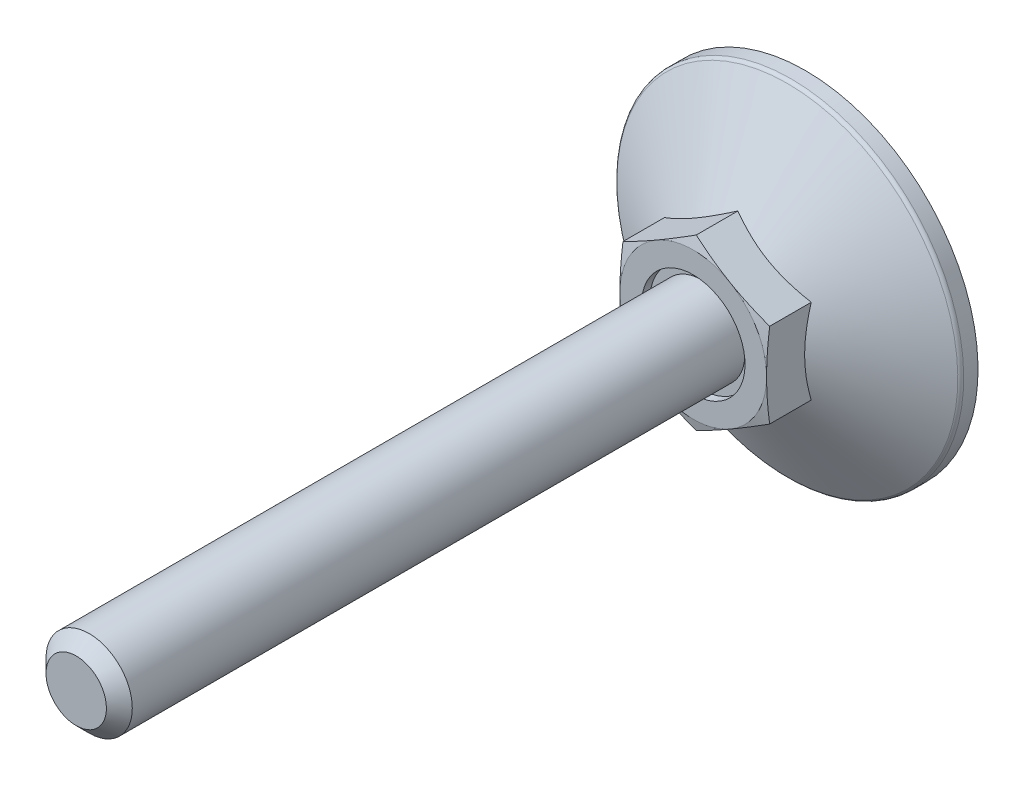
ISO-10303-21;
HEADER;
FILE_DESCRIPTION(('STEP AP214'),'2;1');
FILE_NAME('part.step','',(''),(''),'','','');
FILE_SCHEMA(('AUTOMOTIVE_DESIGN { 1 0 10303 214 1 1 1 1 }'));
ENDSEC;
DATA;
#1=APPLICATION_CONTEXT('core data for automotive mechanical design processes');
#2=APPLICATION_PROTOCOL_DEFINITION('international standard','automotive_design',2000,#1);
#3=PRODUCT_CONTEXT('',#1,'mechanical');
#4=PRODUCT('Part','Part','',(#3));
#5=PRODUCT_RELATED_PRODUCT_CATEGORY('part','',(#4));
#6=PRODUCT_DEFINITION_FORMATION('','',#4);
#7=PRODUCT_DEFINITION_CONTEXT('part definition',#1,'design');
#8=PRODUCT_DEFINITION('design','',#6,#7);
#9=PRODUCT_DEFINITION_SHAPE('','',#8);
#10=(LENGTH_UNIT() NAMED_UNIT(*) SI_UNIT(.MILLI.,.METRE.));
#11=(NAMED_UNIT(*) PLANE_ANGLE_UNIT() SI_UNIT($,.RADIAN.));
#12=(NAMED_UNIT(*) SI_UNIT($,.STERADIAN.) SOLID_ANGLE_UNIT());
#13=UNCERTAINTY_MEASURE_WITH_UNIT(LENGTH_MEASURE(1.E-05),#10,'distance_accuracy_value','');
#14=(GEOMETRIC_REPRESENTATION_CONTEXT(3) GLOBAL_UNCERTAINTY_ASSIGNED_CONTEXT((#13)) GLOBAL_UNIT_ASSIGNED_CONTEXT((#10,
#11,#12)) REPRESENTATION_CONTEXT('',''));
#15=CARTESIAN_POINT('',(0.,0.,0.));
#16=DIRECTION('',(0.,0.,1.));
#17=DIRECTION('',(1.,0.,0.));
#18=AXIS2_PLACEMENT_3D('',#15,#16,#17);
#19=CARTESIAN_POINT('',(10.2,0.,0.));
#20=DIRECTION('',(0.,0.,1.));
#21=DIRECTION('',(0.,-1.,0.));
#22=AXIS2_PLACEMENT_3D('',#19,#20,#21);
#23=PLANE('',#22);
#24=DIRECTION('',(1.,0.,0.));
#25=VECTOR('',#24,1.);
#26=CARTESIAN_POINT('',(1.,-1.,0.));
#27=LINE('',#26,#25);
#28=CARTESIAN_POINT('',(1.,-1.,0.));
#29=VERTEX_POINT('',#28);
#30=CARTESIAN_POINT('',(6.66666666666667,-1.,0.));
#31=VERTEX_POINT('',#30);
#32=EDGE_CURVE('E355',#29,#31,#27,.T.);
#33=ORIENTED_EDGE('',*,*,#32,.T.);
#34=DIRECTION('',(0.,-1.,0.));
#35=VECTOR('',#34,1.);
#36=CARTESIAN_POINT('',(6.66666666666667,0.,0.));
#37=LINE('',#36,#35);
#38=CARTESIAN_POINT('',(6.66666666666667,1.,0.));
#39=VERTEX_POINT('',#38);
#40=EDGE_CURVE('E375',#39,#31,#37,.T.);
#41=ORIENTED_EDGE('',*,*,#40,.F.);
#42=DIRECTION('',(-1.,0.,0.));
#43=VECTOR('',#42,1.);
#44=CARTESIAN_POINT('',(6.66666666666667,1.,0.));
#45=LINE('',#44,#43);
#46=CARTESIAN_POINT('',(1.,1.,0.));
#47=VERTEX_POINT('',#46);
#48=EDGE_CURVE('E659',#39,#47,#45,.T.);
#49=ORIENTED_EDGE('',*,*,#48,.T.);
#50=DIRECTION('',(0.,1.,0.));
#51=VECTOR('',#50,1.);
#52=CARTESIAN_POINT('',(1.,1.,0.));
#53=LINE('',#52,#51);
#54=CARTESIAN_POINT('',(1.,6.66666666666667,0.));
#55=VERTEX_POINT('',#54);
#56=EDGE_CURVE('E656',#47,#55,#53,.T.);
#57=ORIENTED_EDGE('',*,*,#56,.T.);
#58=DIRECTION('',(-1.,0.,0.));
#59=VECTOR('',#58,1.);
#60=CARTESIAN_POINT('',(1.,6.66666666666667,0.));
#61=LINE('',#60,#59);
#62=CARTESIAN_POINT('',(-1.,6.66666666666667,0.));
#63=VERTEX_POINT('',#62);
#64=EDGE_CURVE('E650',#55,#63,#61,.T.);
#65=ORIENTED_EDGE('',*,*,#64,.T.);
#66=DIRECTION('',(0.,-1.,0.));
#67=VECTOR('',#66,1.);
#68=CARTESIAN_POINT('',(-1.,6.66666666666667,0.));
#69=LINE('',#68,#67);
#70=CARTESIAN_POINT('',(-1.,1.,0.));
#71=VERTEX_POINT('',#70);
#72=EDGE_CURVE('E175',#63,#71,#69,.T.);
#73=ORIENTED_EDGE('',*,*,#72,.T.);
#74=DIRECTION('',(-1.,0.,0.));
#75=VECTOR('',#74,1.);
#76=CARTESIAN_POINT('',(-1.,1.,0.));
#77=LINE('',#76,#75);
#78=CARTESIAN_POINT('',(-6.66666666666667,1.,0.));
#79=VERTEX_POINT('',#78);
#80=EDGE_CURVE('E29',#71,#79,#77,.T.);
#81=ORIENTED_EDGE('',*,*,#80,.T.);
#82=DIRECTION('',(0.,-1.,0.));
#83=VECTOR('',#82,1.);
#84=CARTESIAN_POINT('',(-6.66666666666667,1.,0.));
#85=LINE('',#84,#83);
#86=CARTESIAN_POINT('',(-6.66666666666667,-1.,0.));
#87=VERTEX_POINT('',#86);
#88=EDGE_CURVE('E179',#79,#87,#85,.T.);
#89=ORIENTED_EDGE('',*,*,#88,.T.);
#90=DIRECTION('',(1.,0.,0.));
#91=VECTOR('',#90,1.);
#92=CARTESIAN_POINT('',(-6.66666666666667,-1.,0.));
#93=LINE('',#92,#91);
#94=CARTESIAN_POINT('',(-1.,-1.,0.));
#95=VERTEX_POINT('',#94);
#96=EDGE_CURVE('E684',#87,#95,#93,.T.);
#97=ORIENTED_EDGE('',*,*,#96,.T.);
#98=DIRECTION('',(0.,-1.,0.));
#99=VECTOR('',#98,1.);
#100=CARTESIAN_POINT('',(-1.,-1.,0.));
#101=LINE('',#100,#99);
#102=CARTESIAN_POINT('',(-1.,-6.66666666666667,0.));
#103=VERTEX_POINT('',#102);
#104=EDGE_CURVE('E686',#95,#103,#101,.T.);
#105=ORIENTED_EDGE('',*,*,#104,.T.);
#106=DIRECTION('',(1.,0.,0.));
#107=VECTOR('',#106,1.);
#108=CARTESIAN_POINT('',(-1.,-6.66666666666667,0.));
#109=LINE('',#108,#107);
#110=CARTESIAN_POINT('',(1.,-6.66666666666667,0.));
#111=VERTEX_POINT('',#110);
#112=EDGE_CURVE('E690',#103,#111,#109,.T.);
#113=ORIENTED_EDGE('',*,*,#112,.T.);
#114=DIRECTION('',(0.,1.,0.));
#115=VECTOR('',#114,1.);
#116=CARTESIAN_POINT('',(1.,-6.66666666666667,0.));
#117=LINE('',#116,#115);
#118=EDGE_CURVE('E697',#111,#29,#117,.T.);
#119=ORIENTED_EDGE('',*,*,#118,.T.);
#120=EDGE_LOOP('',(#33,#41,#49,#57,#65,#73,#81,#89,#97,#105,#113,#119));
#121=FACE_BOUND('',#120,.T.);
#122=CARTESIAN_POINT('',(0.,0.,0.));
#123=DIRECTION('',(0.,0.,-1.));
#124=DIRECTION('',(0.,1.,0.));
#125=AXIS2_PLACEMENT_3D('',#122,#123,#124);
#126=CIRCLE('',#125,20.);
#127=CARTESIAN_POINT('',(0.,20.,0.));
#128=VERTEX_POINT('',#127);
#129=EDGE_CURVE('E184',#128,#128,#126,.T.);
#130=ORIENTED_EDGE('',*,*,#129,.T.);
#131=EDGE_LOOP('',(#130));
#132=FACE_BOUND('',#131,.T.);
#133=ADVANCED_FACE('F14',(#121,#132),#23,.F.);
#134=CARTESIAN_POINT('',(0.,0.,12.025));
#135=DIRECTION('',(0.,0.,-1.));
#136=DIRECTION('',(0.,1.,0.));
#137=AXIS2_PLACEMENT_3D('',#134,#135,#136);
#138=PLANE('',#137);
#139=CARTESIAN_POINT('',(0.,0.,12.025));
#140=DIRECTION('',(0.,0.,-1.));
#141=DIRECTION('',(0.,1.,0.));
#142=AXIS2_PLACEMENT_3D('',#139,#140,#141);
#143=CIRCLE('',#142,6.);
#144=CARTESIAN_POINT('',(0.,6.,12.025));
#145=VERTEX_POINT('',#144);
#146=EDGE_CURVE('E376',#145,#145,#143,.T.);
#147=ORIENTED_EDGE('',*,*,#146,.F.);
#148=EDGE_LOOP('',(#147));
#149=FACE_BOUND('',#148,.T.);
#150=CARTESIAN_POINT('',(0.,0.,12.025));
#151=DIRECTION('',(0.,0.,-1.));
#152=DIRECTION('',(0.,1.,0.));
#153=AXIS2_PLACEMENT_3D('',#150,#151,#152);
#154=CIRCLE('',#153,5.);
#155=CARTESIAN_POINT('',(0.,5.,12.025));
#156=VERTEX_POINT('',#155);
#157=EDGE_CURVE('E180',#156,#156,#154,.F.);
#158=ORIENTED_EDGE('',*,*,#157,.F.);
#159=EDGE_LOOP('',(#158));
#160=FACE_BOUND('',#159,.T.);
#161=ADVANCED_FACE('F343',(#149,#160),#138,.F.);
#162=CARTESIAN_POINT('',(0.,9.81495457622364,39.));
#163=DIRECTION('',(0.5,-0.866025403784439,0.));
#164=DIRECTION('',(0.866025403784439,0.5,0.));
#165=AXIS2_PLACEMENT_3D('',#162,#163,#164);
#166=PLANE('',#165);
#167=CARTESIAN_POINT('',(-8.5002,4.90736181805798,7.83027204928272));
#168=CARTESIAN_POINT('',(-8.31336077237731,5.01523349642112,7.89254195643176));
#169=CARTESIAN_POINT('',(-8.1258249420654,5.1235073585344,7.95198579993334));
#170=CARTESIAN_POINT('',(-7.74923024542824,5.34093440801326,8.06444298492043));
#171=CARTESIAN_POINT('',(-7.56017075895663,5.45008795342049,8.1174535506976));
#172=CARTESIAN_POINT('',(-6.9899652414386,5.77929626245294,8.26579470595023));
#173=CARTESIAN_POINT('',(-6.60656835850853,6.00065055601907,8.3501691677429));
#174=CARTESIAN_POINT('',(-6.03282233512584,6.33190297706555,8.44910807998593));
#175=CARTESIAN_POINT('',(-5.84418723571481,6.44081150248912,8.47729289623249));
#176=CARTESIAN_POINT('',(-5.46606397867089,6.65912106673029,8.52455401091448));
#177=CARTESIAN_POINT('',(-5.27657589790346,6.76852206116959,8.54363111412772));
#178=CARTESIAN_POINT('',(-4.8972734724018,6.98751241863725,8.57219332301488));
#179=CARTESIAN_POINT('',(-4.7074597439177,7.09710142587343,8.58168931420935));
#180=CARTESIAN_POINT('',(-4.32765694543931,7.3163806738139,8.59088571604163));
#181=CARTESIAN_POINT('',(-4.13766788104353,7.42607091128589,8.59058642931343));
#182=CARTESIAN_POINT('',(-3.78247698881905,7.63114046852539,8.58087362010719));
#183=CARTESIAN_POINT('',(-3.6172500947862,7.72653426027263,8.57264492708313));
#184=CARTESIAN_POINT('',(-3.28718328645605,7.9170984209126,8.54893885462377));
#185=CARTESIAN_POINT('',(-3.12234339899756,8.01226877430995,8.53346098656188));
#186=CARTESIAN_POINT('',(-2.62846189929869,8.29741139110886,8.47651947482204));
#187=CARTESIAN_POINT('',(-2.30029449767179,8.48687892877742,8.42455503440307));
#188=CARTESIAN_POINT('',(-1.64047857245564,8.86782383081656,8.29464315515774));
#189=CARTESIAN_POINT('',(-1.30891425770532,9.05925257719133,8.21614502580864));
#190=CARTESIAN_POINT('',(-0.650730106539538,9.43925537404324,8.03798675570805));
#191=CARTESIAN_POINT('',(-0.324101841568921,9.62783429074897,7.93836845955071));
#192=CARTESIAN_POINT('',(0.000199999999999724,9.81507004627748,7.83027204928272));
#193=B_SPLINE_CURVE_WITH_KNOTS('',3,(#167,#168,#169,#170,#171,#172,#173,#174,#175,#176,#177,
#178,#179,#180,#181,#182,#183,#184,#185,#186,#187,#188,#189,#190,#191,#192),.UNSPECIFIED.,.F.,
.F.,(4,2,2,2,2,2,2,2,2,2,2,2,4),(0.,0.673596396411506,1.34748239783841,2.69805431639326,
3.356799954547,4.01548737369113,4.67342558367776,5.33134346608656,5.90409556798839,
6.47688628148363,7.62328361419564,8.79510569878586,9.9646274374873),.UNSPECIFIED.);
#194=CARTESIAN_POINT('',(-8.5,4.90747728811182,7.83033871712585));
#195=VERTEX_POINT('',#194);
#196=CARTESIAN_POINT('',(0.,9.81495457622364,7.83033871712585));
#197=VERTEX_POINT('',#196);
#198=EDGE_CURVE('E254',#195,#197,#193,.T.);
#199=ORIENTED_EDGE('',*,*,#198,.F.);
#200=DIRECTION('',(0.,0.,-1.));
#201=VECTOR('',#200,1.);
#202=CARTESIAN_POINT('',(-8.5,4.90747728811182,39.));
#203=LINE('',#202,#201);
#204=CARTESIAN_POINT('',(-8.5,4.90747728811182,12.6476589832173));
#205=VERTEX_POINT('',#204);
#206=EDGE_CURVE('E429',#205,#195,#203,.T.);
#207=ORIENTED_EDGE('',*,*,#206,.F.);
#208=CARTESIAN_POINT('',(0.000200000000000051,9.81507004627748,12.6476280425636));
#209=CARTESIAN_POINT('',(-0.352800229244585,9.61126526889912,12.7022599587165));
#210=CARTESIAN_POINT('',(-0.706440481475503,9.40709097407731,12.7518566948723));
#211=CARTESIAN_POINT('',(-1.41496987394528,8.99802133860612,12.8389934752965));
#212=CARTESIAN_POINT('',(-1.76985946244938,8.79312573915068,12.8765286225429));
#213=CARTESIAN_POINT('',(-2.47873586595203,8.38385575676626,12.9373509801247));
#214=CARTESIAN_POINT('',(-2.83271788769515,8.17948414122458,12.9607107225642));
#215=CARTESIAN_POINT('',(-3.5411333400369,7.77048028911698,12.9920337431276));
#216=CARTESIAN_POINT('',(-3.89556667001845,7.56584811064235,13.));
#217=CARTESIAN_POINT('',(-4.60443332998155,7.15658375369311,13.));
#218=CARTESIAN_POINT('',(-4.9588666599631,6.95195157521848,12.9920337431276));
#219=CARTESIAN_POINT('',(-5.66728211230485,6.54294772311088,12.9607107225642));
#220=CARTESIAN_POINT('',(-6.02126413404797,6.33857610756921,12.9373509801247));
#221=CARTESIAN_POINT('',(-6.73014053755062,5.92930612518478,12.8765286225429));
#222=CARTESIAN_POINT('',(-7.08503012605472,5.72441052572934,12.8389934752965));
#223=CARTESIAN_POINT('',(-7.7935595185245,5.31534089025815,12.7518566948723));
#224=CARTESIAN_POINT('',(-8.14719977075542,5.11116659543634,12.7022599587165));
#225=CARTESIAN_POINT('',(-8.5002,4.90736181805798,12.6476280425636));
#226=B_SPLINE_CURVE_WITH_KNOTS('',3,(#208,#209,#210,#211,#212,#213,#214,#215,#216,#217,#218,
#219,#220,#221,#222,#223,#224,#225),.UNSPECIFIED.,.F.,.F.,(4,2,2,2,2,2,2,2,4),(0.,
1.23382789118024,2.46815608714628,3.69611406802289,4.92383440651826,6.15155474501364,
7.37951272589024,8.61384092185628,9.84766881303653),.UNSPECIFIED.);
#227=CARTESIAN_POINT('',(-4.25,7.36121593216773,13.));
#228=VERTEX_POINT('',#227);
#229=EDGE_CURVE('E284',#228,#205,#226,.T.);
#230=ORIENTED_EDGE('',*,*,#229,.F.);
#231=CARTESIAN_POINT('',(0.,9.81495457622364,12.6476589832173));
#232=VERTEX_POINT('',#231);
#233=EDGE_CURVE('E394',#232,#228,#226,.T.);
#234=ORIENTED_EDGE('',*,*,#233,.F.);
#235=DIRECTION('',(0.,0.,-1.));
#236=VECTOR('',#235,1.);
#237=CARTESIAN_POINT('',(0.,9.81495457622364,39.));
#238=LINE('',#237,#236);
#239=EDGE_CURVE('E415',#232,#197,#238,.T.);
#240=ORIENTED_EDGE('',*,*,#239,.T.);
#241=EDGE_LOOP('',(#199,#207,#230,#234,#240));
#242=FACE_BOUND('',#241,.T.);
#243=ADVANCED_FACE('F226',(#242),#166,.F.);
#244=CARTESIAN_POINT('',(8.5,4.90747728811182,39.));
#245=DIRECTION('',(-0.5,-0.866025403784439,0.));
#246=DIRECTION('',(0.866025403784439,-0.5,0.));
#247=AXIS2_PLACEMENT_3D('',#244,#245,#246);
#248=PLANE('',#247);
#249=CARTESIAN_POINT('',(-0.0002,9.81507004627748,7.83027204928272));
#250=CARTESIAN_POINT('',(0.186639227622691,9.70719836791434,7.89254195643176));
#251=CARTESIAN_POINT('',(0.374175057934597,9.59892450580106,7.95198579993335));
#252=CARTESIAN_POINT('',(0.750769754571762,9.3814974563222,8.06444298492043));
#253=CARTESIAN_POINT('',(0.939829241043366,9.27234391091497,8.1174535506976));
#254=CARTESIAN_POINT('',(1.5100347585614,8.94313560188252,8.26579470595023));
#255=CARTESIAN_POINT('',(1.89343164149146,8.72178130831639,8.3501691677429));
#256=CARTESIAN_POINT('',(2.46717766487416,8.39052888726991,8.44910807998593));
#257=CARTESIAN_POINT('',(2.65581276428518,8.28162036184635,8.47729289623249));
#258=CARTESIAN_POINT('',(3.03393602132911,8.06331079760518,8.52455401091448));
#259=CARTESIAN_POINT('',(3.22342410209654,7.95390980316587,8.54363111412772));
#260=CARTESIAN_POINT('',(3.6027265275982,7.73491944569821,8.57219332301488));
#261=CARTESIAN_POINT('',(3.79254025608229,7.62533043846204,8.58168931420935));
#262=CARTESIAN_POINT('',(4.17234305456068,7.40605119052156,8.59088571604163));
#263=CARTESIAN_POINT('',(4.36233211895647,7.29636095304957,8.59058642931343));
#264=CARTESIAN_POINT('',(4.71752301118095,7.09129139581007,8.58087362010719));
#265=CARTESIAN_POINT('',(4.8827499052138,6.99589760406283,8.57264492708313));
#266=CARTESIAN_POINT('',(5.21281671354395,6.80533344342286,8.54893885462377));
#267=CARTESIAN_POINT('',(5.37765660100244,6.71016309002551,8.53346098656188));
#268=CARTESIAN_POINT('',(5.87153810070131,6.42502047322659,8.47651947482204));
#269=CARTESIAN_POINT('',(6.19970550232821,6.23555293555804,8.42455503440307));
#270=CARTESIAN_POINT('',(6.85952142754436,5.8546080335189,8.29464315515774));
#271=CARTESIAN_POINT('',(7.19108574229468,5.66317928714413,8.21614502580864));
#272=CARTESIAN_POINT('',(7.84926989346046,5.28317649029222,8.03798675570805));
#273=CARTESIAN_POINT('',(8.17589815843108,5.09459757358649,7.93836845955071));
#274=CARTESIAN_POINT('',(8.5002,4.90736181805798,7.83027204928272));
#275=B_SPLINE_CURVE_WITH_KNOTS('',3,(#249,#250,#251,#252,#253,#254,#255,#256,#257,#258,#259,
#260,#261,#262,#263,#264,#265,#266,#267,#268,#269,#270,#271,#272,#273,#274),.UNSPECIFIED.,.F.,
.F.,(4,2,2,2,2,2,2,2,2,2,2,2,4),(0.,0.673596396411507,1.34748239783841,2.69805431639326,
3.35679995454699,4.01548737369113,4.67342558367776,5.33134346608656,5.90409556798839,
6.47688628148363,7.62328361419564,8.79510569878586,9.9646274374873),.UNSPECIFIED.);
#276=CARTESIAN_POINT('',(8.5,4.90747728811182,7.83033871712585));
#277=VERTEX_POINT('',#276);
#278=EDGE_CURVE('E37',#197,#277,#275,.T.);
#279=ORIENTED_EDGE('',*,*,#278,.F.);
#280=ORIENTED_EDGE('',*,*,#239,.F.);
#281=CARTESIAN_POINT('',(8.5002,4.90736181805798,12.6476280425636));
#282=CARTESIAN_POINT('',(8.14719977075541,5.11116659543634,12.7022599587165));
#283=CARTESIAN_POINT('',(7.7935595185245,5.31534089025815,12.7518566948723));
#284=CARTESIAN_POINT('',(7.08503012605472,5.72441052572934,12.8389934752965));
#285=CARTESIAN_POINT('',(6.73014053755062,5.92930612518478,12.8765286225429));
#286=CARTESIAN_POINT('',(6.02126413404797,6.33857610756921,12.9373509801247));
#287=CARTESIAN_POINT('',(5.66728211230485,6.54294772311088,12.9607107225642));
#288=CARTESIAN_POINT('',(4.9588666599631,6.95195157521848,12.9920337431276));
#289=CARTESIAN_POINT('',(4.60443332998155,7.15658375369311,13.));
#290=CARTESIAN_POINT('',(3.89556667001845,7.56584811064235,13.));
#291=CARTESIAN_POINT('',(3.5411333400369,7.77048028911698,12.9920337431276));
#292=CARTESIAN_POINT('',(2.83271788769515,8.17948414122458,12.9607107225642));
#293=CARTESIAN_POINT('',(2.47873586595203,8.38385575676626,12.9373509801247));
#294=CARTESIAN_POINT('',(1.76985946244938,8.79312573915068,12.8765286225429));
#295=CARTESIAN_POINT('',(1.41496987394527,8.99802133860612,12.8389934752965));
#296=CARTESIAN_POINT('',(0.7064404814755,9.40709097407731,12.7518566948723));
#297=CARTESIAN_POINT('',(0.352800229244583,9.61126526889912,12.7022599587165));
#298=CARTESIAN_POINT('',(-0.000200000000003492,9.81507004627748,12.6476280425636));
#299=B_SPLINE_CURVE_WITH_KNOTS('',3,(#281,#282,#283,#284,#285,#286,#287,#288,#289,#290,#291,
#292,#293,#294,#295,#296,#297,#298),.UNSPECIFIED.,.F.,.F.,(4,2,2,2,2,2,2,2,4),(0.,
1.23382789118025,2.46815608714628,3.69611406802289,4.92383440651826,6.15155474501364,
7.37951272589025,8.61384092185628,9.84766881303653),.UNSPECIFIED.);
#300=CARTESIAN_POINT('',(4.25,7.36121593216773,13.));
#301=VERTEX_POINT('',#300);
#302=EDGE_CURVE('E267',#301,#232,#299,.T.);
#303=ORIENTED_EDGE('',*,*,#302,.F.);
#304=CARTESIAN_POINT('',(8.5,4.90747728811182,12.6476589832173));
#305=VERTEX_POINT('',#304);
#306=EDGE_CURVE('E276',#305,#301,#299,.T.);
#307=ORIENTED_EDGE('',*,*,#306,.F.);
#308=DIRECTION('',(0.,0.,-1.));
#309=VECTOR('',#308,1.);
#310=CARTESIAN_POINT('',(8.5,4.90747728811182,39.));
#311=LINE('',#310,#309);
#312=EDGE_CURVE('E417',#305,#277,#311,.T.);
#313=ORIENTED_EDGE('',*,*,#312,.T.);
#314=EDGE_LOOP('',(#279,#280,#303,#307,#313));
#315=FACE_BOUND('',#314,.T.);
#316=ADVANCED_FACE('F260',(#315),#248,.F.);
#317=CARTESIAN_POINT('',(8.5,-4.90747728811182,39.));
#318=DIRECTION('',(-1.,0.,0.));
#319=DIRECTION('',(0.,-1.,0.));
#320=AXIS2_PLACEMENT_3D('',#317,#318,#319);
#321=PLANE('',#320);
#322=CARTESIAN_POINT('',(8.5,12.8220542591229,4.61528116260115));
#323=CARTESIAN_POINT('',(8.5,12.4534155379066,4.79262377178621));
#324=CARTESIAN_POINT('',(8.5,12.0838902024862,4.96815716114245));
#325=CARTESIAN_POINT('',(8.5,11.3425927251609,5.31457894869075));
#326=CARTESIAN_POINT('',(8.5,10.9708202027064,5.48546653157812));
#327=CARTESIAN_POINT('',(8.5,10.2224625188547,5.82250763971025));
#328=CARTESIAN_POINT('',(8.5,9.84586188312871,5.98862693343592));
#329=CARTESIAN_POINT('',(8.5,9.08953299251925,6.31355867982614));
#330=CARTESIAN_POINT('',(8.5,8.70980489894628,6.47237150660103));
#331=CARTESIAN_POINT('',(8.5,7.93635853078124,6.78489169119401));
#332=CARTESIAN_POINT('',(8.5,7.5425381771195,6.93834789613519));
#333=CARTESIAN_POINT('',(8.5,6.75016193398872,7.23275009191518));
#334=CARTESIAN_POINT('',(8.5,6.35160550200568,7.37369463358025));
#335=CARTESIAN_POINT('',(8.5,5.54998630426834,7.63911020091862));
#336=CARTESIAN_POINT('',(8.5,5.14693580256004,7.76361784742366));
#337=CARTESIAN_POINT('',(8.5,4.33508769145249,7.99193558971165));
#338=CARTESIAN_POINT('',(8.5,3.92629204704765,8.09575258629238));
#339=CARTESIAN_POINT('',(8.5,3.10458766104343,8.27700176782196));
#340=CARTESIAN_POINT('',(8.5,2.69170444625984,8.35454642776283));
#341=CARTESIAN_POINT('',(8.5,2.06892742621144,8.44757828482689));
#342=CARTESIAN_POINT('',(8.5,1.86074253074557,8.47470931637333));
#343=CARTESIAN_POINT('',(8.5,1.44346514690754,8.52067173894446));
#344=CARTESIAN_POINT('',(8.5,1.23437274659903,8.5395039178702));
#345=CARTESIAN_POINT('',(8.5,0.818123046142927,8.5682751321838));
#346=CARTESIAN_POINT('',(8.5,0.6109730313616,8.57831925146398));
#347=CARTESIAN_POINT('',(8.5,0.196434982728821,8.58967320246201));
#348=CARTESIAN_POINT('',(8.5,-0.0109530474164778,8.59098316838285));
#349=CARTESIAN_POINT('',(8.5,-0.425608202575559,8.58483724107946));
#350=CARTESIAN_POINT('',(8.5,-0.632875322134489,8.57738097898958));
#351=CARTESIAN_POINT('',(8.5,-1.04692490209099,8.55387613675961));
#352=CARTESIAN_POINT('',(8.5,-1.25370733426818,8.5378270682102));
#353=CARTESIAN_POINT('',(8.5,-1.76172684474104,8.48816674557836));
#354=CARTESIAN_POINT('',(8.5,-2.06251418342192,8.44986872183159));
#355=CARTESIAN_POINT('',(8.5,-2.66160170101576,8.35726697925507));
#356=CARTESIAN_POINT('',(8.5,-2.95990148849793,8.30296078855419));
#357=CARTESIAN_POINT('',(8.5,-3.85084347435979,8.11893322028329));
#358=CARTESIAN_POINT('',(8.5,-4.4391769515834,7.96814146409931));
#359=CARTESIAN_POINT('',(8.5,-5.31919968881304,7.70971639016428));
#360=CARTESIAN_POINT('',(8.5,-5.61551051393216,7.61694416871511));
#361=CARTESIAN_POINT('',(8.5,-6.20524874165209,7.4225646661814));
#362=CARTESIAN_POINT('',(8.5,-6.4986761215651,7.3209573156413));
#363=CARTESIAN_POINT('',(8.5,-7.08276471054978,7.11046965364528));
#364=CARTESIAN_POINT('',(8.5,-7.37342689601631,7.0015920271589));
#365=CARTESIAN_POINT('',(8.5,-7.95239195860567,6.77777126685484));
#366=CARTESIAN_POINT('',(8.5,-8.2406948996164,6.66282829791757));
#367=CARTESIAN_POINT('',(8.5,-8.80562449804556,6.43181846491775));
#368=CARTESIAN_POINT('',(8.5,-9.08231928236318,6.31591764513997));
#369=CARTESIAN_POINT('',(8.5,-9.63401072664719,6.0801365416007));
#370=CARTESIAN_POINT('',(8.5,-9.90900735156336,5.96025617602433));
#371=CARTESIAN_POINT('',(8.5,-10.7318217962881,5.59557173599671));
#372=CARTESIAN_POINT('',(8.5,-11.2774137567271,5.34574521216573));
#373=CARTESIAN_POINT('',(8.5,-12.3642460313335,4.83628492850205));
#374=CARTESIAN_POINT('',(8.5,-12.905484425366,4.57664710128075));
#375=CARTESIAN_POINT('',(8.5,-13.9843891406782,4.05013469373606));
#376=CARTESIAN_POINT('',(8.5,-14.5220556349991,3.78326046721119));
#377=CARTESIAN_POINT('',(8.5,-15.5954930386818,3.24355438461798));
#378=CARTESIAN_POINT('',(8.5,-16.1312593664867,2.97071343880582));
#379=CARTESIAN_POINT('',(8.5,-17.2005865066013,2.4207361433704));
#380=CARTESIAN_POINT('',(8.5,-17.7341472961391,2.14359974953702));
#381=CARTESIAN_POINT('',(8.5,-18.7993643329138,1.58600707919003));
#382=CARTESIAN_POINT('',(8.5,-19.3310210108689,1.30555162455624));
#383=CARTESIAN_POINT('',(8.5,-20.3928917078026,0.741921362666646));
#384=CARTESIAN_POINT('',(8.5,-20.9231057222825,0.458746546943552));
#385=CARTESIAN_POINT('',(8.5,-22.3874236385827,-0.32722037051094));
#386=CARTESIAN_POINT('',(8.5,-23.3202800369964,-0.83233607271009));
#387=CARTESIAN_POINT('',(8.5,-25.1833983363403,-1.84747335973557));
#388=CARTESIAN_POINT('',(8.5,-26.1136600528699,-2.35749528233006));
#389=CARTESIAN_POINT('',(8.5,-27.9692131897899,-3.37950461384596));
#390=CARTESIAN_POINT('',(8.5,-28.8945109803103,-3.89148046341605));
#391=CARTESIAN_POINT('',(8.5,-30.2812847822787,-4.66146611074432));
#392=CARTESIAN_POINT('',(8.5,-30.7433285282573,-4.91845451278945));
#393=CARTESIAN_POINT('',(8.5,-31.6670795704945,-5.43303439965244));
#394=CARTESIAN_POINT('',(8.5,-32.1287868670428,-5.69062588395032));
#395=CARTESIAN_POINT('',(8.5,-32.5903473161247,-5.94848028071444));
#396=B_SPLINE_CURVE_WITH_KNOTS('',3,(#322,#323,#324,#325,#326,#327,#328,#329,#330,#331,#332,
#333,#334,#335,#336,#337,#338,#339,#340,#341,#342,#343,#344,#345,#346,#347,#348,#349,#350,#351,
#352,#353,#354,#355,#356,#357,#358,#359,#360,#361,#362,#363,#364,#365,#366,#367,#368,#369,#370,
#371,#372,#373,#374,#375,#376,#377,#378,#379,#380,#381,#382,#383,#384,#385,#386,#387,#388,#389,
#390,#391,#392,#393,#394,#395),.UNSPECIFIED.,.F.,.F.,(4,2,2,2,2,2,2,2,2,2,2,2,2,2,2,2,2,2,2,2,2,
2,2,2,2,2,2,2,2,2,2,2,2,2,2,2,4),(0.,1.22725127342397,2.45471654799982,3.68948778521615,
4.92419572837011,6.19201746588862,7.45998585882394,8.72507978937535,9.98975107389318,
11.2489376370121,11.878634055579,12.5082706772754,13.1302712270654,13.7522622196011,
14.3742793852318,14.9963319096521,15.9054589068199,16.814726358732,18.6343169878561,
19.5657329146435,20.4971561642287,21.4282373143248,22.3592931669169,23.259222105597,
24.1591695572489,25.9592281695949,27.7600413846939,29.5607667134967,31.3644583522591,
33.1681685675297,34.9714411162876,36.7747192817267,39.9571898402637,43.1398810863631,
46.3123590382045,47.8984694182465,49.4845784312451),.UNSPECIFIED.);
#397=CARTESIAN_POINT('',(8.5,-4.90747728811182,7.83033871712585));
#398=VERTEX_POINT('',#397);
#399=EDGE_CURVE('E243',#277,#398,#396,.T.);
#400=ORIENTED_EDGE('',*,*,#399,.F.);
#401=ORIENTED_EDGE('',*,*,#312,.F.);
#402=CARTESIAN_POINT('',(8.5,12.9820891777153,11.1197370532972));
#403=CARTESIAN_POINT('',(8.5,12.5964686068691,11.2061594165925));
#404=CARTESIAN_POINT('',(8.5,12.2106068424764,11.2915248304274));
#405=CARTESIAN_POINT('',(8.5,11.4382824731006,11.4595712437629));
#406=CARTESIAN_POINT('',(8.5,11.0518198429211,11.5422521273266));
#407=CARTESIAN_POINT('',(8.5,10.2778290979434,11.7044309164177));
#408=CARTESIAN_POINT('',(8.5,9.89030030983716,11.7839256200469));
#409=CARTESIAN_POINT('',(8.5,9.11443612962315,11.9388739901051));
#410=CARTESIAN_POINT('',(8.5,8.72610074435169,12.0143276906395));
#411=CARTESIAN_POINT('',(8.5,7.95158013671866,12.159650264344));
#412=CARTESIAN_POINT('',(8.5,7.56540239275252,12.2295587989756));
#413=CARTESIAN_POINT('',(8.5,6.79199352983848,12.3632725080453));
#414=CARTESIAN_POINT('',(8.5,6.40476243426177,12.4270778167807));
#415=CARTESIAN_POINT('',(8.5,5.62917169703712,12.54714843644));
#416=CARTESIAN_POINT('',(8.5,5.24081220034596,12.6034146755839));
#417=CARTESIAN_POINT('',(8.5,4.46285737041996,12.70674908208));
#418=CARTESIAN_POINT('',(8.5,4.07326203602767,12.7538172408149));
#419=CARTESIAN_POINT('',(8.5,3.28844017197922,12.8374226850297));
#420=CARTESIAN_POINT('',(8.5,2.89320002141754,12.8738340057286));
#421=CARTESIAN_POINT('',(8.5,2.10172608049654,12.9336139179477));
#422=CARTESIAN_POINT('',(8.5,1.70549231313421,12.9569828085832));
#423=CARTESIAN_POINT('',(8.5,0.912605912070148,12.9893148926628));
#424=CARTESIAN_POINT('',(8.5,0.515953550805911,12.9982846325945));
#425=CARTESIAN_POINT('',(8.5,-0.27740821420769,13.0012669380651));
#426=CARTESIAN_POINT('',(8.5,-0.674117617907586,12.9952795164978));
#427=CARTESIAN_POINT('',(8.5,-1.46847963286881,12.9686842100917));
#428=CARTESIAN_POINT('',(8.5,-1.86613043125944,12.9480232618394));
#429=CARTESIAN_POINT('',(8.5,-2.66049684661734,12.8932602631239));
#430=CARTESIAN_POINT('',(8.5,-3.05721244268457,12.8591579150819));
#431=CARTESIAN_POINT('',(8.5,-3.84970511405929,12.7792347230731));
#432=CARTESIAN_POINT('',(8.5,-4.24548140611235,12.7334062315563));
#433=CARTESIAN_POINT('',(8.5,-5.03576028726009,12.6319377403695));
#434=CARTESIAN_POINT('',(8.5,-5.43026287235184,12.5762977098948));
#435=CARTESIAN_POINT('',(8.5,-6.19195385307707,12.4609360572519));
#436=CARTESIAN_POINT('',(8.5,-6.55922094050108,12.4017287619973));
#437=CARTESIAN_POINT('',(8.5,-7.29278719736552,12.2775674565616));
#438=CARTESIAN_POINT('',(8.5,-7.65908634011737,12.2126132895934));
#439=CARTESIAN_POINT('',(8.5,-8.39085027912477,12.078008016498));
#440=CARTESIAN_POINT('',(8.5,-8.75631499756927,12.0083564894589));
#441=CARTESIAN_POINT('',(8.5,-9.48649515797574,11.8652200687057));
#442=CARTESIAN_POINT('',(8.5,-9.85121059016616,11.7917351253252));
#443=CARTESIAN_POINT('',(8.5,-10.5800753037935,11.6416087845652));
#444=CARTESIAN_POINT('',(8.5,-10.944224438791,11.5649666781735));
#445=CARTESIAN_POINT('',(8.5,-11.6719684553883,11.4090909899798));
#446=CARTESIAN_POINT('',(8.5,-12.0355633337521,11.3298573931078));
#447=CARTESIAN_POINT('',(8.5,-13.1255915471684,11.0889686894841));
#448=CARTESIAN_POINT('',(8.5,-13.8513178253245,10.9241153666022));
#449=CARTESIAN_POINT('',(8.5,-15.2942598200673,10.590109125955));
#450=CARTESIAN_POINT('',(8.5,-16.0114890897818,10.421014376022));
#451=CARTESIAN_POINT('',(8.5,-17.4449475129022,10.0785875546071));
#452=CARTESIAN_POINT('',(8.5,-18.1611766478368,9.9052554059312));
#453=CARTESIAN_POINT('',(8.5,-19.5919856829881,9.55567998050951));
#454=CARTESIAN_POINT('',(8.5,-20.306566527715,9.37944056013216));
#455=CARTESIAN_POINT('',(8.5,-21.7351057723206,9.02455520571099));
#456=CARTESIAN_POINT('',(8.5,-22.4490641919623,8.84590935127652));
#457=CARTESIAN_POINT('',(8.5,-23.1628057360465,8.66641079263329));
#458=B_SPLINE_CURVE_WITH_KNOTS('',3,(#402,#403,#404,#405,#406,#407,#408,#409,#410,#411,#412,
#413,#414,#415,#416,#417,#418,#419,#420,#421,#422,#423,#424,#425,#426,#427,#428,#429,#430,#431,
#432,#433,#434,#435,#436,#437,#438,#439,#440,#441,#442,#443,#444,#445,#446,#447,#448,#449,#450,
#451,#452,#453,#454,#455,#456,#457),.UNSPECIFIED.,.F.,.F.,(4,2,2,2,2,2,2,2,2,2,2,2,2,2,2,2,2,2,
2,2,2,2,2,2,2,2,2,4),(0.,1.18556310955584,2.37117735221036,3.5579546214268,4.74472187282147,
5.92204594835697,7.09934411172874,8.27649719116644,9.45365137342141,10.6442044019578,
11.8347301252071,13.0247144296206,14.2146977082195,15.4090063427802,16.6033414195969,
17.7984574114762,18.9935771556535,20.1095500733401,21.2255534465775,22.3416569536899,
23.4577749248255,24.5741449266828,25.6905214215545,27.9231231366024,30.1337863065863,
32.3444897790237,34.5524651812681,36.7603677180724),.UNSPECIFIED.);
#459=CARTESIAN_POINT('',(8.5,0.,13.));
#460=VERTEX_POINT('',#459);
#461=EDGE_CURVE('E278',#460,#305,#458,.F.);
#462=ORIENTED_EDGE('',*,*,#461,.F.);
#463=CARTESIAN_POINT('',(8.5,-4.90747728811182,12.6476589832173));
#464=VERTEX_POINT('',#463);
#465=EDGE_CURVE('E277',#464,#460,#458,.F.);
#466=ORIENTED_EDGE('',*,*,#465,.F.);
#467=DIRECTION('',(0.,0.,-1.));
#468=VECTOR('',#467,1.);
#469=CARTESIAN_POINT('',(8.5,-4.90747728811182,39.));
#470=LINE('',#469,#468);
#471=EDGE_CURVE('E420',#464,#398,#470,.T.);
#472=ORIENTED_EDGE('',*,*,#471,.T.);
#473=EDGE_LOOP('',(#400,#401,#462,#466,#472));
#474=FACE_BOUND('',#473,.T.);
#475=ADVANCED_FACE('F263',(#474),#321,.F.);
#476=CARTESIAN_POINT('',(0.,-9.81495457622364,39.));
#477=DIRECTION('',(-0.5,0.866025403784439,0.));
#478=DIRECTION('',(-0.866025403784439,-0.5,0.));
#479=AXIS2_PLACEMENT_3D('',#476,#477,#478);
#480=PLANE('',#479);
#481=CARTESIAN_POINT('',(8.5002,-4.90736181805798,7.83027204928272));
#482=CARTESIAN_POINT('',(8.31336077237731,-5.01523349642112,7.89254195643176));
#483=CARTESIAN_POINT('',(8.1258249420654,-5.1235073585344,7.95198579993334));
#484=CARTESIAN_POINT('',(7.74923024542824,-5.34093440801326,8.06444298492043));
#485=CARTESIAN_POINT('',(7.56017075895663,-5.45008795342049,8.1174535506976));
#486=CARTESIAN_POINT('',(6.9899652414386,-5.77929626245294,8.26579470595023));
#487=CARTESIAN_POINT('',(6.60656835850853,-6.00065055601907,8.3501691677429));
#488=CARTESIAN_POINT('',(6.03282233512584,-6.33190297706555,8.44910807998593));
#489=CARTESIAN_POINT('',(5.84418723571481,-6.44081150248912,8.47729289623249));
#490=CARTESIAN_POINT('',(5.46606397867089,-6.65912106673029,8.52455401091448));
#491=CARTESIAN_POINT('',(5.27657589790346,-6.76852206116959,8.54363111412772));
#492=CARTESIAN_POINT('',(4.8972734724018,-6.98751241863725,8.57219332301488));
#493=CARTESIAN_POINT('',(4.7074597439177,-7.09710142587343,8.58168931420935));
#494=CARTESIAN_POINT('',(4.32765694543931,-7.3163806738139,8.59088571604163));
#495=CARTESIAN_POINT('',(4.13766788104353,-7.42607091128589,8.59058642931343));
#496=CARTESIAN_POINT('',(3.78247698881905,-7.63114046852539,8.58087362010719));
#497=CARTESIAN_POINT('',(3.6172500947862,-7.72653426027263,8.57264492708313));
#498=CARTESIAN_POINT('',(3.28718328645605,-7.9170984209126,8.54893885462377));
#499=CARTESIAN_POINT('',(3.12234339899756,-8.01226877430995,8.53346098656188));
#500=CARTESIAN_POINT('',(2.62846189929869,-8.29741139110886,8.47651947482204));
#501=CARTESIAN_POINT('',(2.30029449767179,-8.48687892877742,8.42455503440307));
#502=CARTESIAN_POINT('',(1.64047857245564,-8.86782383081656,8.29464315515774));
#503=CARTESIAN_POINT('',(1.30891425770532,-9.05925257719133,8.21614502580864));
#504=CARTESIAN_POINT('',(0.650730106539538,-9.43925537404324,8.03798675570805));
#505=CARTESIAN_POINT('',(0.324101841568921,-9.62783429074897,7.93836845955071));
#506=CARTESIAN_POINT('',(-0.000199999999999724,-9.81507004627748,7.83027204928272));
#507=B_SPLINE_CURVE_WITH_KNOTS('',3,(#481,#482,#483,#484,#485,#486,#487,#488,#489,#490,#491,
#492,#493,#494,#495,#496,#497,#498,#499,#500,#501,#502,#503,#504,#505,#506),.UNSPECIFIED.,.F.,
.F.,(4,2,2,2,2,2,2,2,2,2,2,2,4),(0.,0.673596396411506,1.34748239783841,2.69805431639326,
3.356799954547,4.01548737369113,4.67342558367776,5.33134346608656,5.90409556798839,
6.47688628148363,7.62328361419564,8.79510569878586,9.9646274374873),.UNSPECIFIED.);
#508=CARTESIAN_POINT('',(0.,-9.81495457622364,7.83033871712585));
#509=VERTEX_POINT('',#508);
#510=EDGE_CURVE('E207',#398,#509,#507,.T.);
#511=ORIENTED_EDGE('',*,*,#510,.F.);
#512=ORIENTED_EDGE('',*,*,#471,.F.);
#513=CARTESIAN_POINT('',(-0.000200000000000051,-9.81507004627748,12.6476280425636));
#514=CARTESIAN_POINT('',(0.352800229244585,-9.61126526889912,12.7022599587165));
#515=CARTESIAN_POINT('',(0.706440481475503,-9.40709097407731,12.7518566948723));
#516=CARTESIAN_POINT('',(1.41496987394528,-8.99802133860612,12.8389934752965));
#517=CARTESIAN_POINT('',(1.76985946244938,-8.79312573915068,12.8765286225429));
#518=CARTESIAN_POINT('',(2.47873586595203,-8.38385575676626,12.9373509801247));
#519=CARTESIAN_POINT('',(2.83271788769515,-8.17948414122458,12.9607107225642));
#520=CARTESIAN_POINT('',(3.5411333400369,-7.77048028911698,12.9920337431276));
#521=CARTESIAN_POINT('',(3.89556667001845,-7.56584811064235,13.));
#522=CARTESIAN_POINT('',(4.60443332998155,-7.15658375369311,13.));
#523=CARTESIAN_POINT('',(4.9588666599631,-6.95195157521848,12.9920337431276));
#524=CARTESIAN_POINT('',(5.66728211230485,-6.54294772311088,12.9607107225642));
#525=CARTESIAN_POINT('',(6.02126413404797,-6.33857610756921,12.9373509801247));
#526=CARTESIAN_POINT('',(6.73014053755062,-5.92930612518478,12.8765286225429));
#527=CARTESIAN_POINT('',(7.08503012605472,-5.72441052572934,12.8389934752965));
#528=CARTESIAN_POINT('',(7.7935595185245,-5.31534089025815,12.7518566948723));
#529=CARTESIAN_POINT('',(8.14719977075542,-5.11116659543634,12.7022599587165));
#530=CARTESIAN_POINT('',(8.5002,-4.90736181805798,12.6476280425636));
#531=B_SPLINE_CURVE_WITH_KNOTS('',3,(#513,#514,#515,#516,#517,#518,#519,#520,#521,#522,#523,
#524,#525,#526,#527,#528,#529,#530),.UNSPECIFIED.,.F.,.F.,(4,2,2,2,2,2,2,2,4),(0.,
1.23382789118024,2.46815608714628,3.69611406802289,4.92383440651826,6.15155474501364,
7.37951272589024,8.61384092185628,9.84766881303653),.UNSPECIFIED.);
#532=CARTESIAN_POINT('',(4.25,-7.36121593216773,13.));
#533=VERTEX_POINT('',#532);
#534=EDGE_CURVE('E319',#533,#464,#531,.T.);
#535=ORIENTED_EDGE('',*,*,#534,.F.);
#536=CARTESIAN_POINT('',(0.,-9.81495457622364,12.6476589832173));
#537=VERTEX_POINT('',#536);
#538=EDGE_CURVE('E325',#537,#533,#531,.T.);
#539=ORIENTED_EDGE('',*,*,#538,.F.);
#540=DIRECTION('',(0.,0.,-1.));
#541=VECTOR('',#540,1.);
#542=CARTESIAN_POINT('',(0.,-9.81495457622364,39.));
#543=LINE('',#542,#541);
#544=EDGE_CURVE('E425',#537,#509,#543,.T.);
#545=ORIENTED_EDGE('',*,*,#544,.T.);
#546=EDGE_LOOP('',(#511,#512,#535,#539,#545));
#547=FACE_BOUND('',#546,.T.);
#548=ADVANCED_FACE('F327',(#547),#480,.F.);
#549=CARTESIAN_POINT('',(-8.5,-4.90747728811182,39.));
#550=DIRECTION('',(0.5,0.866025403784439,0.));
#551=DIRECTION('',(-0.866025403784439,0.5,0.));
#552=AXIS2_PLACEMENT_3D('',#549,#550,#551);
#553=PLANE('',#552);
#554=CARTESIAN_POINT('',(0.0002,-9.81507004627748,7.83027204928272));
#555=CARTESIAN_POINT('',(-0.186639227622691,-9.70719836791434,7.89254195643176));
#556=CARTESIAN_POINT('',(-0.374175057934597,-9.59892450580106,7.95198579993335));
#557=CARTESIAN_POINT('',(-0.750769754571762,-9.3814974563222,8.06444298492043));
#558=CARTESIAN_POINT('',(-0.939829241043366,-9.27234391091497,8.1174535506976));
#559=CARTESIAN_POINT('',(-1.5100347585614,-8.94313560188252,8.26579470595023));
#560=CARTESIAN_POINT('',(-1.89343164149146,-8.72178130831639,8.3501691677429));
#561=CARTESIAN_POINT('',(-2.46717766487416,-8.39052888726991,8.44910807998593));
#562=CARTESIAN_POINT('',(-2.65581276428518,-8.28162036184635,8.47729289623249));
#563=CARTESIAN_POINT('',(-3.03393602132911,-8.06331079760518,8.52455401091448));
#564=CARTESIAN_POINT('',(-3.22342410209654,-7.95390980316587,8.54363111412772));
#565=CARTESIAN_POINT('',(-3.6027265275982,-7.73491944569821,8.57219332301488));
#566=CARTESIAN_POINT('',(-3.79254025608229,-7.62533043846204,8.58168931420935));
#567=CARTESIAN_POINT('',(-4.17234305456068,-7.40605119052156,8.59088571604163));
#568=CARTESIAN_POINT('',(-4.36233211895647,-7.29636095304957,8.59058642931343));
#569=CARTESIAN_POINT('',(-4.71752301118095,-7.09129139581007,8.58087362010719));
#570=CARTESIAN_POINT('',(-4.8827499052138,-6.99589760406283,8.57264492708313));
#571=CARTESIAN_POINT('',(-5.21281671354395,-6.80533344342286,8.54893885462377));
#572=CARTESIAN_POINT('',(-5.37765660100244,-6.71016309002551,8.53346098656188));
#573=CARTESIAN_POINT('',(-5.87153810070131,-6.42502047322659,8.47651947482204));
#574=CARTESIAN_POINT('',(-6.19970550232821,-6.23555293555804,8.42455503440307));
#575=CARTESIAN_POINT('',(-6.85952142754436,-5.8546080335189,8.29464315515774));
#576=CARTESIAN_POINT('',(-7.19108574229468,-5.66317928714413,8.21614502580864));
#577=CARTESIAN_POINT('',(-7.84926989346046,-5.28317649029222,8.03798675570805));
#578=CARTESIAN_POINT('',(-8.17589815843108,-5.09459757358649,7.93836845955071));
#579=CARTESIAN_POINT('',(-8.5002,-4.90736181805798,7.83027204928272));
#580=B_SPLINE_CURVE_WITH_KNOTS('',3,(#554,#555,#556,#557,#558,#559,#560,#561,#562,#563,#564,
#565,#566,#567,#568,#569,#570,#571,#572,#573,#574,#575,#576,#577,#578,#579),.UNSPECIFIED.,.F.,
.F.,(4,2,2,2,2,2,2,2,2,2,2,2,4),(0.,0.673596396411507,1.34748239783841,2.69805431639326,
3.35679995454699,4.01548737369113,4.67342558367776,5.33134346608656,5.90409556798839,
6.47688628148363,7.62328361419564,8.79510569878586,9.9646274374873),.UNSPECIFIED.);
#581=CARTESIAN_POINT('',(-8.5,-4.90747728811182,7.83033871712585));
#582=VERTEX_POINT('',#581);
#583=EDGE_CURVE('E198',#509,#582,#580,.T.);
#584=ORIENTED_EDGE('',*,*,#583,.F.);
#585=ORIENTED_EDGE('',*,*,#544,.F.);
#586=CARTESIAN_POINT('',(-8.5002,-4.90736181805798,12.6476280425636));
#587=CARTESIAN_POINT('',(-8.14719977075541,-5.11116659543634,12.7022599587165));
#588=CARTESIAN_POINT('',(-7.7935595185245,-5.31534089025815,12.7518566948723));
#589=CARTESIAN_POINT('',(-7.08503012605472,-5.72441052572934,12.8389934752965));
#590=CARTESIAN_POINT('',(-6.73014053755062,-5.92930612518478,12.8765286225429));
#591=CARTESIAN_POINT('',(-6.02126413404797,-6.33857610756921,12.9373509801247));
#592=CARTESIAN_POINT('',(-5.66728211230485,-6.54294772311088,12.9607107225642));
#593=CARTESIAN_POINT('',(-4.9588666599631,-6.95195157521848,12.9920337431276));
#594=CARTESIAN_POINT('',(-4.60443332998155,-7.15658375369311,13.));
#595=CARTESIAN_POINT('',(-3.89556667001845,-7.56584811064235,13.));
#596=CARTESIAN_POINT('',(-3.5411333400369,-7.77048028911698,12.9920337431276));
#597=CARTESIAN_POINT('',(-2.83271788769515,-8.17948414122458,12.9607107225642));
#598=CARTESIAN_POINT('',(-2.47873586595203,-8.38385575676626,12.9373509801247));
#599=CARTESIAN_POINT('',(-1.76985946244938,-8.79312573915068,12.8765286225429));
#600=CARTESIAN_POINT('',(-1.41496987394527,-8.99802133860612,12.8389934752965));
#601=CARTESIAN_POINT('',(-0.7064404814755,-9.40709097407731,12.7518566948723));
#602=CARTESIAN_POINT('',(-0.352800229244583,-9.61126526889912,12.7022599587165));
#603=CARTESIAN_POINT('',(0.000200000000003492,-9.81507004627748,12.6476280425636));
#604=B_SPLINE_CURVE_WITH_KNOTS('',3,(#586,#587,#588,#589,#590,#591,#592,#593,#594,#595,#596,
#597,#598,#599,#600,#601,#602,#603),.UNSPECIFIED.,.F.,.F.,(4,2,2,2,2,2,2,2,4),(0.,
1.23382789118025,2.46815608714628,3.69611406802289,4.92383440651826,6.15155474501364,
7.37951272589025,8.61384092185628,9.84766881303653),.UNSPECIFIED.);
#605=CARTESIAN_POINT('',(-4.25,-7.36121593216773,13.));
#606=VERTEX_POINT('',#605);
#607=EDGE_CURVE('E313',#606,#537,#604,.T.);
#608=ORIENTED_EDGE('',*,*,#607,.F.);
#609=CARTESIAN_POINT('',(-8.5,-4.90747728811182,12.6476589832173));
#610=VERTEX_POINT('',#609);
#611=EDGE_CURVE('E326',#610,#606,#604,.T.);
#612=ORIENTED_EDGE('',*,*,#611,.F.);
#613=DIRECTION('',(0.,0.,-1.));
#614=VECTOR('',#613,1.);
#615=CARTESIAN_POINT('',(-8.5,-4.90747728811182,39.));
#616=LINE('',#615,#614);
#617=EDGE_CURVE('E428',#610,#582,#616,.T.);
#618=ORIENTED_EDGE('',*,*,#617,.T.);
#619=EDGE_LOOP('',(#584,#585,#608,#612,#618));
#620=FACE_BOUND('',#619,.T.);
#621=ADVANCED_FACE('F214',(#620),#553,.F.);
#622=CARTESIAN_POINT('',(-8.5,4.90747728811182,39.));
#623=DIRECTION('',(1.,0.,0.));
#624=DIRECTION('',(0.,1.,0.));
#625=AXIS2_PLACEMENT_3D('',#622,#623,#624);
#626=PLANE('',#625);
#627=CARTESIAN_POINT('',(-8.5,12.8220542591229,4.61528116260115));
#628=CARTESIAN_POINT('',(-8.5,12.4534155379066,4.79262377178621));
#629=CARTESIAN_POINT('',(-8.5,12.0838902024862,4.96815716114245));
#630=CARTESIAN_POINT('',(-8.5,11.3425927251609,5.31457894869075));
#631=CARTESIAN_POINT('',(-8.5,10.9708202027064,5.48546653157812));
#632=CARTESIAN_POINT('',(-8.5,10.2224625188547,5.82250763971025));
#633=CARTESIAN_POINT('',(-8.5,9.84586188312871,5.98862693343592));
#634=CARTESIAN_POINT('',(-8.5,9.08953299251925,6.31355867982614));
#635=CARTESIAN_POINT('',(-8.5,8.70980489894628,6.47237150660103));
#636=CARTESIAN_POINT('',(-8.5,7.93635853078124,6.78489169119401));
#637=CARTESIAN_POINT('',(-8.5,7.5425381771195,6.93834789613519));
#638=CARTESIAN_POINT('',(-8.5,6.75016193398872,7.23275009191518));
#639=CARTESIAN_POINT('',(-8.5,6.35160550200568,7.37369463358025));
#640=CARTESIAN_POINT('',(-8.5,5.54998630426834,7.63911020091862));
#641=CARTESIAN_POINT('',(-8.5,5.14693580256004,7.76361784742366));
#642=CARTESIAN_POINT('',(-8.5,4.33508769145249,7.99193558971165));
#643=CARTESIAN_POINT('',(-8.5,3.92629204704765,8.09575258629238));
#644=CARTESIAN_POINT('',(-8.5,3.10458766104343,8.27700176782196));
#645=CARTESIAN_POINT('',(-8.5,2.69170444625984,8.35454642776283));
#646=CARTESIAN_POINT('',(-8.5,2.06892742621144,8.44757828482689));
#647=CARTESIAN_POINT('',(-8.5,1.86074253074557,8.47470931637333));
#648=CARTESIAN_POINT('',(-8.5,1.44346514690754,8.52067173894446));
#649=CARTESIAN_POINT('',(-8.5,1.23437274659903,8.5395039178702));
#650=CARTESIAN_POINT('',(-8.5,0.818123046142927,8.5682751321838));
#651=CARTESIAN_POINT('',(-8.5,0.6109730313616,8.57831925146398));
#652=CARTESIAN_POINT('',(-8.5,0.196434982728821,8.58967320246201));
#653=CARTESIAN_POINT('',(-8.5,-0.0109530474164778,8.59098316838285));
#654=CARTESIAN_POINT('',(-8.5,-0.425608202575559,8.58483724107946));
#655=CARTESIAN_POINT('',(-8.5,-0.632875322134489,8.57738097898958));
#656=CARTESIAN_POINT('',(-8.5,-1.04692490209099,8.55387613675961));
#657=CARTESIAN_POINT('',(-8.5,-1.25370733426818,8.5378270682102));
#658=CARTESIAN_POINT('',(-8.5,-1.76172684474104,8.48816674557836));
#659=CARTESIAN_POINT('',(-8.5,-2.06251418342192,8.44986872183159));
#660=CARTESIAN_POINT('',(-8.5,-2.66160170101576,8.35726697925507));
#661=CARTESIAN_POINT('',(-8.5,-2.95990148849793,8.30296078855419));
#662=CARTESIAN_POINT('',(-8.5,-3.85084347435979,8.11893322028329));
#663=CARTESIAN_POINT('',(-8.5,-4.4391769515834,7.96814146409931));
#664=CARTESIAN_POINT('',(-8.5,-5.31919968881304,7.70971639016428));
#665=CARTESIAN_POINT('',(-8.5,-5.61551051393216,7.61694416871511));
#666=CARTESIAN_POINT('',(-8.5,-6.20524874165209,7.4225646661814));
#667=CARTESIAN_POINT('',(-8.5,-6.4986761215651,7.3209573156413));
#668=CARTESIAN_POINT('',(-8.5,-7.08276471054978,7.11046965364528));
#669=CARTESIAN_POINT('',(-8.5,-7.37342689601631,7.0015920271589));
#670=CARTESIAN_POINT('',(-8.5,-7.95239195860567,6.77777126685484));
#671=CARTESIAN_POINT('',(-8.5,-8.2406948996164,6.66282829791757));
#672=CARTESIAN_POINT('',(-8.5,-8.80562449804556,6.43181846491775));
#673=CARTESIAN_POINT('',(-8.5,-9.08231928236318,6.31591764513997));
#674=CARTESIAN_POINT('',(-8.5,-9.63401072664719,6.0801365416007));
#675=CARTESIAN_POINT('',(-8.5,-9.90900735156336,5.96025617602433));
#676=CARTESIAN_POINT('',(-8.5,-10.7318217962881,5.59557173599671));
#677=CARTESIAN_POINT('',(-8.5,-11.2774137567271,5.34574521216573));
#678=CARTESIAN_POINT('',(-8.5,-12.3642460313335,4.83628492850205));
#679=CARTESIAN_POINT('',(-8.5,-12.905484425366,4.57664710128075));
#680=CARTESIAN_POINT('',(-8.5,-13.9843891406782,4.05013469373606));
#681=CARTESIAN_POINT('',(-8.5,-14.5220556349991,3.78326046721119));
#682=CARTESIAN_POINT('',(-8.5,-15.5954930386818,3.24355438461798));
#683=CARTESIAN_POINT('',(-8.5,-16.1312593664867,2.97071343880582));
#684=CARTESIAN_POINT('',(-8.5,-17.2005865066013,2.4207361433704));
#685=CARTESIAN_POINT('',(-8.5,-17.7341472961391,2.14359974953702));
#686=CARTESIAN_POINT('',(-8.5,-18.7993643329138,1.58600707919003));
#687=CARTESIAN_POINT('',(-8.5,-19.3310210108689,1.30555162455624));
#688=CARTESIAN_POINT('',(-8.5,-20.3928917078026,0.741921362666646));
#689=CARTESIAN_POINT('',(-8.5,-20.9231057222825,0.458746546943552));
#690=CARTESIAN_POINT('',(-8.5,-22.3874236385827,-0.32722037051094));
#691=CARTESIAN_POINT('',(-8.5,-23.3202800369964,-0.83233607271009));
#692=CARTESIAN_POINT('',(-8.5,-25.1833983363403,-1.84747335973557));
#693=CARTESIAN_POINT('',(-8.5,-26.1136600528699,-2.35749528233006));
#694=CARTESIAN_POINT('',(-8.5,-27.9692131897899,-3.37950461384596));
#695=CARTESIAN_POINT('',(-8.5,-28.8945109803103,-3.89148046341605));
#696=CARTESIAN_POINT('',(-8.5,-30.2812847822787,-4.66146611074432));
#697=CARTESIAN_POINT('',(-8.5,-30.7433285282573,-4.91845451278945));
#698=CARTESIAN_POINT('',(-8.5,-31.6670795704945,-5.43303439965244));
#699=CARTESIAN_POINT('',(-8.5,-32.1287868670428,-5.69062588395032));
#700=CARTESIAN_POINT('',(-8.5,-32.5903473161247,-5.94848028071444));
#701=B_SPLINE_CURVE_WITH_KNOTS('',3,(#627,#628,#629,#630,#631,#632,#633,#634,#635,#636,#637,
#638,#639,#640,#641,#642,#643,#644,#645,#646,#647,#648,#649,#650,#651,#652,#653,#654,#655,#656,
#657,#658,#659,#660,#661,#662,#663,#664,#665,#666,#667,#668,#669,#670,#671,#672,#673,#674,#675,
#676,#677,#678,#679,#680,#681,#682,#683,#684,#685,#686,#687,#688,#689,#690,#691,#692,#693,#694,
#695,#696,#697,#698,#699,#700),.UNSPECIFIED.,.F.,.F.,(4,2,2,2,2,2,2,2,2,2,2,2,2,2,2,2,2,2,2,2,2,
2,2,2,2,2,2,2,2,2,2,2,2,2,2,2,4),(0.,1.22725127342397,2.45471654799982,3.68948778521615,
4.92419572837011,6.19201746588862,7.45998585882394,8.72507978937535,9.98975107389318,
11.2489376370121,11.878634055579,12.5082706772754,13.1302712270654,13.7522622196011,
14.3742793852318,14.9963319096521,15.9054589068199,16.814726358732,18.6343169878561,
19.5657329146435,20.4971561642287,21.4282373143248,22.3592931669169,23.259222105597,
24.1591695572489,25.9592281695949,27.7600413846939,29.5607667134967,31.3644583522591,
33.1681685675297,34.9714411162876,36.7747192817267,39.9571898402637,43.1398810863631,
46.3123590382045,47.8984694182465,49.4845784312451),.UNSPECIFIED.);
#702=EDGE_CURVE('E232',#582,#195,#701,.F.);
#703=ORIENTED_EDGE('',*,*,#702,.F.);
#704=ORIENTED_EDGE('',*,*,#617,.F.);
#705=CARTESIAN_POINT('',(-8.5,12.9820891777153,11.1197370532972));
#706=CARTESIAN_POINT('',(-8.5,12.5964686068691,11.2061594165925));
#707=CARTESIAN_POINT('',(-8.5,12.2106068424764,11.2915248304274));
#708=CARTESIAN_POINT('',(-8.5,11.4382824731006,11.4595712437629));
#709=CARTESIAN_POINT('',(-8.5,11.0518198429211,11.5422521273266));
#710=CARTESIAN_POINT('',(-8.5,10.2778290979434,11.7044309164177));
#711=CARTESIAN_POINT('',(-8.5,9.89030030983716,11.7839256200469));
#712=CARTESIAN_POINT('',(-8.5,9.11443612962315,11.9388739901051));
#713=CARTESIAN_POINT('',(-8.5,8.72610074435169,12.0143276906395));
#714=CARTESIAN_POINT('',(-8.5,7.95158013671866,12.159650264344));
#715=CARTESIAN_POINT('',(-8.5,7.56540239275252,12.2295587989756));
#716=CARTESIAN_POINT('',(-8.5,6.79199352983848,12.3632725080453));
#717=CARTESIAN_POINT('',(-8.5,6.40476243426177,12.4270778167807));
#718=CARTESIAN_POINT('',(-8.5,5.62917169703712,12.54714843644));
#719=CARTESIAN_POINT('',(-8.5,5.24081220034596,12.6034146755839));
#720=CARTESIAN_POINT('',(-8.5,4.46285737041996,12.70674908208));
#721=CARTESIAN_POINT('',(-8.5,4.07326203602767,12.7538172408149));
#722=CARTESIAN_POINT('',(-8.5,3.28844017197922,12.8374226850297));
#723=CARTESIAN_POINT('',(-8.5,2.89320002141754,12.8738340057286));
#724=CARTESIAN_POINT('',(-8.5,2.10172608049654,12.9336139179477));
#725=CARTESIAN_POINT('',(-8.5,1.70549231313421,12.9569828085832));
#726=CARTESIAN_POINT('',(-8.5,0.912605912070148,12.9893148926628));
#727=CARTESIAN_POINT('',(-8.5,0.515953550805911,12.9982846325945));
#728=CARTESIAN_POINT('',(-8.5,-0.27740821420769,13.0012669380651));
#729=CARTESIAN_POINT('',(-8.5,-0.674117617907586,12.9952795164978));
#730=CARTESIAN_POINT('',(-8.5,-1.46847963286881,12.9686842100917));
#731=CARTESIAN_POINT('',(-8.5,-1.86613043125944,12.9480232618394));
#732=CARTESIAN_POINT('',(-8.5,-2.66049684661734,12.8932602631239));
#733=CARTESIAN_POINT('',(-8.5,-3.05721244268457,12.8591579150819));
#734=CARTESIAN_POINT('',(-8.5,-3.84970511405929,12.7792347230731));
#735=CARTESIAN_POINT('',(-8.5,-4.24548140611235,12.7334062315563));
#736=CARTESIAN_POINT('',(-8.5,-5.03576028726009,12.6319377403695));
#737=CARTESIAN_POINT('',(-8.5,-5.43026287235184,12.5762977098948));
#738=CARTESIAN_POINT('',(-8.5,-6.19195385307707,12.4609360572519));
#739=CARTESIAN_POINT('',(-8.5,-6.55922094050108,12.4017287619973));
#740=CARTESIAN_POINT('',(-8.5,-7.29278719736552,12.2775674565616));
#741=CARTESIAN_POINT('',(-8.5,-7.65908634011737,12.2126132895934));
#742=CARTESIAN_POINT('',(-8.5,-8.39085027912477,12.078008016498));
#743=CARTESIAN_POINT('',(-8.5,-8.75631499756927,12.0083564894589));
#744=CARTESIAN_POINT('',(-8.5,-9.48649515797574,11.8652200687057));
#745=CARTESIAN_POINT('',(-8.5,-9.85121059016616,11.7917351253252));
#746=CARTESIAN_POINT('',(-8.5,-10.5800753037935,11.6416087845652));
#747=CARTESIAN_POINT('',(-8.5,-10.944224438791,11.5649666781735));
#748=CARTESIAN_POINT('',(-8.5,-11.6719684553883,11.4090909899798));
#749=CARTESIAN_POINT('',(-8.5,-12.0355633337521,11.3298573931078));
#750=CARTESIAN_POINT('',(-8.5,-13.1255915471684,11.0889686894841));
#751=CARTESIAN_POINT('',(-8.5,-13.8513178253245,10.9241153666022));
#752=CARTESIAN_POINT('',(-8.5,-15.2942598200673,10.590109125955));
#753=CARTESIAN_POINT('',(-8.5,-16.0114890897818,10.421014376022));
#754=CARTESIAN_POINT('',(-8.5,-17.4449475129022,10.0785875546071));
#755=CARTESIAN_POINT('',(-8.5,-18.1611766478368,9.9052554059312));
#756=CARTESIAN_POINT('',(-8.5,-19.5919856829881,9.55567998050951));
#757=CARTESIAN_POINT('',(-8.5,-20.306566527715,9.37944056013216));
#758=CARTESIAN_POINT('',(-8.5,-21.7351057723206,9.02455520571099));
#759=CARTESIAN_POINT('',(-8.5,-22.4490641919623,8.84590935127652));
#760=CARTESIAN_POINT('',(-8.5,-23.1628057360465,8.66641079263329));
#761=B_SPLINE_CURVE_WITH_KNOTS('',3,(#705,#706,#707,#708,#709,#710,#711,#712,#713,#714,#715,
#716,#717,#718,#719,#720,#721,#722,#723,#724,#725,#726,#727,#728,#729,#730,#731,#732,#733,#734,
#735,#736,#737,#738,#739,#740,#741,#742,#743,#744,#745,#746,#747,#748,#749,#750,#751,#752,#753,
#754,#755,#756,#757,#758,#759,#760),.UNSPECIFIED.,.F.,.F.,(4,2,2,2,2,2,2,2,2,2,2,2,2,2,2,2,2,2,
2,2,2,2,2,2,2,2,2,4),(0.,1.18556310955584,2.37117735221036,3.5579546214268,4.74472187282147,
5.92204594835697,7.09934411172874,8.27649719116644,9.45365137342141,10.6442044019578,
11.8347301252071,13.0247144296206,14.2146977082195,15.4090063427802,16.6033414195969,
17.7984574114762,18.9935771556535,20.1095500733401,21.2255534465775,22.3416569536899,
23.4577749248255,24.5741449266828,25.6905214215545,27.9231231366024,30.1337863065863,
32.3444897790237,34.5524651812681,36.7603677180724),.UNSPECIFIED.);
#762=CARTESIAN_POINT('',(-8.5,0.,13.));
#763=VERTEX_POINT('',#762);
#764=EDGE_CURVE('E304',#763,#610,#761,.T.);
#765=ORIENTED_EDGE('',*,*,#764,.F.);
#766=EDGE_CURVE('E419',#205,#763,#761,.T.);
#767=ORIENTED_EDGE('',*,*,#766,.F.);
#768=ORIENTED_EDGE('',*,*,#206,.T.);
#769=EDGE_LOOP('',(#703,#704,#765,#767,#768));
#770=FACE_BOUND('',#769,.T.);
#771=ADVANCED_FACE('F338',(#770),#626,.F.);
#772=CARTESIAN_POINT('',(0.,0.,13.));
#773=DIRECTION('',(0.,0.,-1.));
#774=DIRECTION('',(0.,1.,0.));
#775=AXIS2_PLACEMENT_3D('',#772,#773,#774);
#776=CONICAL_SURFACE('',#775,8.5,1.30899693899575);
#777=ORIENTED_EDGE('',*,*,#534,.T.);
#778=ORIENTED_EDGE('',*,*,#465,.T.);
#779=CARTESIAN_POINT('',(0.,0.,13.));
#780=DIRECTION('',(0.,0.,-1.));
#781=DIRECTION('',(0.,1.,0.));
#782=AXIS2_PLACEMENT_3D('',#779,#780,#781);
#783=CIRCLE('',#782,8.5);
#784=EDGE_CURVE('E382',#460,#533,#783,.T.);
#785=ORIENTED_EDGE('',*,*,#784,.T.);
#786=EDGE_LOOP('',(#777,#778,#785));
#787=FACE_BOUND('',#786,.T.);
#788=ADVANCED_FACE('F298',(#787),#776,.T.);
#789=EDGE_CURVE('E386',#301,#460,#783,.T.);
#790=ORIENTED_EDGE('',*,*,#789,.T.);
#791=ORIENTED_EDGE('',*,*,#461,.T.);
#792=ORIENTED_EDGE('',*,*,#306,.T.);
#793=EDGE_LOOP('',(#790,#791,#792));
#794=FACE_BOUND('',#793,.T.);
#795=ADVANCED_FACE('F408',(#794),#776,.T.);
#796=EDGE_CURVE('E393',#228,#301,#783,.T.);
#797=ORIENTED_EDGE('',*,*,#796,.T.);
#798=ORIENTED_EDGE('',*,*,#302,.T.);
#799=ORIENTED_EDGE('',*,*,#233,.T.);
#800=EDGE_LOOP('',(#797,#798,#799));
#801=FACE_BOUND('',#800,.T.);
#802=ADVANCED_FACE('F414',(#801),#776,.T.);
#803=ORIENTED_EDGE('',*,*,#607,.T.);
#804=ORIENTED_EDGE('',*,*,#538,.T.);
#805=EDGE_CURVE('E385',#533,#606,#783,.T.);
#806=ORIENTED_EDGE('',*,*,#805,.T.);
#807=EDGE_LOOP('',(#803,#804,#806));
#808=FACE_BOUND('',#807,.T.);
#809=ADVANCED_FACE('F751',(#808),#776,.T.);
#810=EDGE_CURVE('E400',#763,#228,#783,.T.);
#811=ORIENTED_EDGE('',*,*,#810,.T.);
#812=ORIENTED_EDGE('',*,*,#229,.T.);
#813=ORIENTED_EDGE('',*,*,#766,.T.);
#814=EDGE_LOOP('',(#811,#812,#813));
#815=FACE_BOUND('',#814,.T.);
#816=ADVANCED_FACE('F299',(#815),#776,.T.);
#817=CARTESIAN_POINT('',(0.,0.,0.));
#818=DIRECTION('',(0.,0.,-1.));
#819=DIRECTION('',(0.,1.,0.));
#820=AXIS2_PLACEMENT_3D('',#817,#818,#819);
#821=CYLINDRICAL_SURFACE('',#820,6.);
#822=CARTESIAN_POINT('',(0.,0.,13.));
#823=DIRECTION('',(0.,0.,-1.));
#824=DIRECTION('',(0.,1.,0.));
#825=AXIS2_PLACEMENT_3D('',#822,#823,#824);
#826=CIRCLE('',#825,6.);
#827=CARTESIAN_POINT('',(0.,6.,13.));
#828=VERTEX_POINT('',#827);
#829=EDGE_CURVE('E378',#828,#828,#826,.T.);
#830=ORIENTED_EDGE('',*,*,#829,.F.);
#831=EDGE_LOOP('',(#830));
#832=FACE_BOUND('',#831,.T.);
#833=ORIENTED_EDGE('',*,*,#146,.T.);
#834=EDGE_LOOP('',(#833));
#835=FACE_BOUND('',#834,.T.);
#836=ADVANCED_FACE('F735',(#832,#835),#821,.F.);
#837=CARTESIAN_POINT('',(6.,0.,13.));
#838=DIRECTION('',(0.,0.,-1.));
#839=DIRECTION('',(0.,1.,0.));
#840=AXIS2_PLACEMENT_3D('',#837,#838,#839);
#841=PLANE('',#840);
#842=ORIENTED_EDGE('',*,*,#784,.F.);
#843=ORIENTED_EDGE('',*,*,#789,.F.);
#844=ORIENTED_EDGE('',*,*,#796,.F.);
#845=ORIENTED_EDGE('',*,*,#810,.F.);
#846=EDGE_CURVE('E391',#606,#763,#783,.T.);
#847=ORIENTED_EDGE('',*,*,#846,.F.);
#848=ORIENTED_EDGE('',*,*,#805,.F.);
#849=EDGE_LOOP('',(#842,#843,#844,#845,#847,#848));
#850=FACE_BOUND('',#849,.T.);
#851=ORIENTED_EDGE('',*,*,#829,.T.);
#852=EDGE_LOOP('',(#851));
#853=FACE_BOUND('',#852,.T.);
#854=ADVANCED_FACE('F296',(#850,#853),#841,.F.);
#855=ORIENTED_EDGE('',*,*,#764,.T.);
#856=ORIENTED_EDGE('',*,*,#611,.T.);
#857=ORIENTED_EDGE('',*,*,#846,.T.);
#858=EDGE_LOOP('',(#855,#856,#857));
#859=FACE_BOUND('',#858,.T.);
#860=ADVANCED_FACE('F290',(#859),#776,.T.);
#861=CARTESIAN_POINT('',(0.,0.,0.));
#862=DIRECTION('',(0.,0.,-1.));
#863=DIRECTION('',(0.,1.,0.));
#864=AXIS2_PLACEMENT_3D('',#861,#862,#863);
#865=CYLINDRICAL_SURFACE('',#864,20.);
#866=ORIENTED_EDGE('',*,*,#129,.F.);
#867=EDGE_LOOP('',(#866));
#868=FACE_BOUND('',#867,.T.);
#869=CARTESIAN_POINT('',(0.,0.,1.66132486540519));
#870=DIRECTION('',(0.,0.,-1.));
#871=DIRECTION('',(0.,1.,0.));
#872=AXIS2_PLACEMENT_3D('',#869,#870,#871);
#873=CIRCLE('',#872,20.);
#874=CARTESIAN_POINT('',(0.,20.,1.66132486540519));
#875=VERTEX_POINT('',#874);
#876=EDGE_CURVE('E192',#875,#875,#873,.T.);
#877=ORIENTED_EDGE('',*,*,#876,.T.);
#878=EDGE_LOOP('',(#877));
#879=FACE_BOUND('',#878,.T.);
#880=ADVANCED_FACE('F295',(#868,#879),#865,.T.);
#881=CARTESIAN_POINT('',(0.,0.,1.66132486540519));
#882=DIRECTION('',(0.,0.,-1.));
#883=DIRECTION('',(0.,1.,0.));
#884=AXIS2_PLACEMENT_3D('',#881,#882,#883);
#885=TOROIDAL_SURFACE('',#884,19.5,0.5);
#886=CARTESIAN_POINT('',(0.,0.,2.0943375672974));
#887=DIRECTION('',(0.,0.,-1.));
#888=DIRECTION('',(0.,1.,0.));
#889=AXIS2_PLACEMENT_3D('',#886,#887,#888);
#890=CIRCLE('',#889,19.75);
#891=CARTESIAN_POINT('',(0.,19.75,2.0943375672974));
#892=VERTEX_POINT('',#891);
#893=EDGE_CURVE('E195',#892,#892,#890,.T.);
#894=ORIENTED_EDGE('',*,*,#893,.T.);
#895=EDGE_LOOP('',(#894));
#896=FACE_BOUND('',#895,.T.);
#897=ORIENTED_EDGE('',*,*,#876,.F.);
#898=EDGE_LOOP('',(#897));
#899=FACE_BOUND('',#898,.T.);
#900=ADVANCED_FACE('F223',(#896,#899),#885,.T.);
#901=CARTESIAN_POINT('',(0.,0.,13.4970053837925));
#902=DIRECTION('',(0.,0.,-1.));
#903=DIRECTION('',(0.,1.,0.));
#904=AXIS2_PLACEMENT_3D('',#901,#902,#903);
#905=CONICAL_SURFACE('',#904,0.,1.0471975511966);
#906=ORIENTED_EDGE('',*,*,#893,.F.);
#907=EDGE_LOOP('',(#906));
#908=FACE_BOUND('',#907,.T.);
#909=ORIENTED_EDGE('',*,*,#702,.T.);
#910=ORIENTED_EDGE('',*,*,#198,.T.);
#911=ORIENTED_EDGE('',*,*,#278,.T.);
#912=ORIENTED_EDGE('',*,*,#399,.T.);
#913=ORIENTED_EDGE('',*,*,#510,.T.);
#914=ORIENTED_EDGE('',*,*,#583,.T.);
#915=EDGE_LOOP('',(#909,#910,#911,#912,#913,#914));
#916=FACE_BOUND('',#915,.T.);
#917=ADVANCED_FACE('F217',(#908,#916),#905,.T.);
#918=CARTESIAN_POINT('',(0.,0.,0.));
#919=DIRECTION('',(0.,0.,-1.));
#920=DIRECTION('',(0.,1.,0.));
#921=AXIS2_PLACEMENT_3D('',#918,#919,#920);
#922=CYLINDRICAL_SURFACE('',#921,5.);
#923=CARTESIAN_POINT('',(0.,0.,83.));
#924=DIRECTION('',(0.,0.,1.));
#925=DIRECTION('',(0.,-1.,0.));
#926=AXIS2_PLACEMENT_3D('',#923,#924,#925);
#927=CIRCLE('',#926,5.);
#928=CARTESIAN_POINT('',(0.,-5.,83.));
#929=VERTEX_POINT('',#928);
#930=EDGE_CURVE('E9',#929,#929,#927,.F.);
#931=ORIENTED_EDGE('',*,*,#930,.T.);
#932=EDGE_LOOP('',(#931));
#933=FACE_BOUND('',#932,.T.);
#934=ORIENTED_EDGE('',*,*,#157,.T.);
#935=EDGE_LOOP('',(#934));
#936=FACE_BOUND('',#935,.T.);
#937=ADVANCED_FACE('F222',(#933,#936),#922,.T.);
#938=CARTESIAN_POINT('',(-1.,1.,1.));
#939=DIRECTION('',(0.,-1.,0.));
#940=DIRECTION('',(1.,0.,0.));
#941=AXIS2_PLACEMENT_3D('',#938,#939,#940);
#942=PLANE('',#941);
#943=ORIENTED_EDGE('',*,*,#80,.F.);
#944=DIRECTION('',(0.,0.,-1.));
#945=VECTOR('',#944,1.);
#946=CARTESIAN_POINT('',(-1.,1.,1.));
#947=LINE('',#946,#945);
#948=CARTESIAN_POINT('',(-1.,1.,1.));
#949=VERTEX_POINT('',#948);
#950=EDGE_CURVE('E174',#949,#71,#947,.T.);
#951=ORIENTED_EDGE('',*,*,#950,.F.);
#952=DIRECTION('',(-1.,0.,0.));
#953=VECTOR('',#952,1.);
#954=CARTESIAN_POINT('',(-1.,1.,1.));
#955=LINE('',#954,#953);
#956=CARTESIAN_POINT('',(-6.66666666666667,1.,1.));
#957=VERTEX_POINT('',#956);
#958=EDGE_CURVE('E165',#949,#957,#955,.T.);
#959=ORIENTED_EDGE('',*,*,#958,.T.);
#960=DIRECTION('',(0.,0.,-1.));
#961=VECTOR('',#960,1.);
#962=CARTESIAN_POINT('',(-6.66666666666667,1.,1.));
#963=LINE('',#962,#961);
#964=EDGE_CURVE('E173',#957,#79,#963,.T.);
#965=ORIENTED_EDGE('',*,*,#964,.T.);
#966=EDGE_LOOP('',(#943,#951,#959,#965));
#967=FACE_BOUND('',#966,.T.);
#968=ADVANCED_FACE('F172',(#967),#942,.T.);
#969=CARTESIAN_POINT('',(-6.66666666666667,1.,1.));
#970=DIRECTION('',(1.,0.,0.));
#971=DIRECTION('',(0.,1.,0.));
#972=AXIS2_PLACEMENT_3D('',#969,#970,#971);
#973=PLANE('',#972);
#974=ORIENTED_EDGE('',*,*,#88,.F.);
#975=ORIENTED_EDGE('',*,*,#964,.F.);
#976=DIRECTION('',(0.,-1.,0.));
#977=VECTOR('',#976,1.);
#978=CARTESIAN_POINT('',(-6.66666666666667,1.,1.));
#979=LINE('',#978,#977);
#980=CARTESIAN_POINT('',(-6.66666666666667,-1.,1.));
#981=VERTEX_POINT('',#980);
#982=EDGE_CURVE('E161',#957,#981,#979,.T.);
#983=ORIENTED_EDGE('',*,*,#982,.T.);
#984=DIRECTION('',(0.,0.,-1.));
#985=VECTOR('',#984,1.);
#986=CARTESIAN_POINT('',(-6.66666666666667,-1.,1.));
#987=LINE('',#986,#985);
#988=EDGE_CURVE('E181',#981,#87,#987,.T.);
#989=ORIENTED_EDGE('',*,*,#988,.T.);
#990=EDGE_LOOP('',(#974,#975,#983,#989));
#991=FACE_BOUND('',#990,.T.);
#992=ADVANCED_FACE('F177',(#991),#973,.T.);
#993=CARTESIAN_POINT('',(-6.66666666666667,-1.,1.));
#994=DIRECTION('',(0.,1.,0.));
#995=DIRECTION('',(-1.,0.,0.));
#996=AXIS2_PLACEMENT_3D('',#993,#994,#995);
#997=PLANE('',#996);
#998=ORIENTED_EDGE('',*,*,#96,.F.);
#999=ORIENTED_EDGE('',*,*,#988,.F.);
#1000=DIRECTION('',(1.,0.,0.));
#1001=VECTOR('',#1000,1.);
#1002=CARTESIAN_POINT('',(-6.66666666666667,-1.,1.));
#1003=LINE('',#1002,#1001);
#1004=CARTESIAN_POINT('',(-1.,-1.,1.));
#1005=VERTEX_POINT('',#1004);
#1006=EDGE_CURVE('E167',#981,#1005,#1003,.T.);
#1007=ORIENTED_EDGE('',*,*,#1006,.T.);
#1008=DIRECTION('',(0.,0.,-1.));
#1009=VECTOR('',#1008,1.);
#1010=CARTESIAN_POINT('',(-1.,-1.,1.));
#1011=LINE('',#1010,#1009);
#1012=EDGE_CURVE('E186',#1005,#95,#1011,.T.);
#1013=ORIENTED_EDGE('',*,*,#1012,.T.);
#1014=EDGE_LOOP('',(#998,#999,#1007,#1013));
#1015=FACE_BOUND('',#1014,.T.);
#1016=ADVANCED_FACE('F503',(#1015),#997,.T.);
#1017=CARTESIAN_POINT('',(-1.,-1.,1.));
#1018=DIRECTION('',(1.,0.,0.));
#1019=DIRECTION('',(0.,1.,0.));
#1020=AXIS2_PLACEMENT_3D('',#1017,#1018,#1019);
#1021=PLANE('',#1020);
#1022=ORIENTED_EDGE('',*,*,#104,.F.);
#1023=ORIENTED_EDGE('',*,*,#1012,.F.);
#1024=DIRECTION('',(0.,-1.,0.));
#1025=VECTOR('',#1024,1.);
#1026=CARTESIAN_POINT('',(-1.,-1.,1.));
#1027=LINE('',#1026,#1025);
#1028=CARTESIAN_POINT('',(-1.,-6.66666666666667,1.));
#1029=VERTEX_POINT('',#1028);
#1030=EDGE_CURVE('E721',#1005,#1029,#1027,.T.);
#1031=ORIENTED_EDGE('',*,*,#1030,.T.);
#1032=DIRECTION('',(0.,0.,-1.));
#1033=VECTOR('',#1032,1.);
#1034=CARTESIAN_POINT('',(-1.,-6.66666666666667,1.));
#1035=LINE('',#1034,#1033);
#1036=EDGE_CURVE('E679',#1029,#103,#1035,.T.);
#1037=ORIENTED_EDGE('',*,*,#1036,.T.);
#1038=EDGE_LOOP('',(#1022,#1023,#1031,#1037));
#1039=FACE_BOUND('',#1038,.T.);
#1040=ADVANCED_FACE('F510',(#1039),#1021,.T.);
#1041=CARTESIAN_POINT('',(-1.,-6.66666666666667,1.));
#1042=DIRECTION('',(0.,1.,0.));
#1043=DIRECTION('',(-1.,0.,0.));
#1044=AXIS2_PLACEMENT_3D('',#1041,#1042,#1043);
#1045=PLANE('',#1044);
#1046=ORIENTED_EDGE('',*,*,#112,.F.);
#1047=ORIENTED_EDGE('',*,*,#1036,.F.);
#1048=DIRECTION('',(1.,0.,0.));
#1049=VECTOR('',#1048,1.);
#1050=CARTESIAN_POINT('',(-1.,-6.66666666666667,1.));
#1051=LINE('',#1050,#1049);
#1052=CARTESIAN_POINT('',(1.,-6.66666666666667,1.));
#1053=VERTEX_POINT('',#1052);
#1054=EDGE_CURVE('E719',#1029,#1053,#1051,.T.);
#1055=ORIENTED_EDGE('',*,*,#1054,.T.);
#1056=DIRECTION('',(0.,0.,-1.));
#1057=VECTOR('',#1056,1.);
#1058=CARTESIAN_POINT('',(1.,-6.66666666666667,1.));
#1059=LINE('',#1058,#1057);
#1060=EDGE_CURVE('E677',#1053,#111,#1059,.T.);
#1061=ORIENTED_EDGE('',*,*,#1060,.T.);
#1062=EDGE_LOOP('',(#1046,#1047,#1055,#1061));
#1063=FACE_BOUND('',#1062,.T.);
#1064=ADVANCED_FACE('F518',(#1063),#1045,.T.);
#1065=CARTESIAN_POINT('',(1.,-6.66666666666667,1.));
#1066=DIRECTION('',(-1.,0.,0.));
#1067=DIRECTION('',(0.,-1.,0.));
#1068=AXIS2_PLACEMENT_3D('',#1065,#1066,#1067);
#1069=PLANE('',#1068);
#1070=ORIENTED_EDGE('',*,*,#118,.F.);
#1071=ORIENTED_EDGE('',*,*,#1060,.F.);
#1072=DIRECTION('',(0.,1.,0.));
#1073=VECTOR('',#1072,1.);
#1074=CARTESIAN_POINT('',(1.,-6.66666666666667,1.));
#1075=LINE('',#1074,#1073);
#1076=CARTESIAN_POINT('',(1.,-1.,1.));
#1077=VERTEX_POINT('',#1076);
#1078=EDGE_CURVE('E717',#1053,#1077,#1075,.T.);
#1079=ORIENTED_EDGE('',*,*,#1078,.T.);
#1080=DIRECTION('',(0.,0.,-1.));
#1081=VECTOR('',#1080,1.);
#1082=CARTESIAN_POINT('',(1.,-1.,1.));
#1083=LINE('',#1082,#1081);
#1084=EDGE_CURVE('E675',#1077,#29,#1083,.T.);
#1085=ORIENTED_EDGE('',*,*,#1084,.T.);
#1086=EDGE_LOOP('',(#1070,#1071,#1079,#1085));
#1087=FACE_BOUND('',#1086,.T.);
#1088=ADVANCED_FACE('F526',(#1087),#1069,.T.);
#1089=CARTESIAN_POINT('',(1.,-1.,1.));
#1090=DIRECTION('',(0.,1.,0.));
#1091=DIRECTION('',(-1.,0.,0.));
#1092=AXIS2_PLACEMENT_3D('',#1089,#1090,#1091);
#1093=PLANE('',#1092);
#1094=ORIENTED_EDGE('',*,*,#32,.F.);
#1095=ORIENTED_EDGE('',*,*,#1084,.F.);
#1096=DIRECTION('',(1.,0.,0.));
#1097=VECTOR('',#1096,1.);
#1098=CARTESIAN_POINT('',(1.,-1.,1.));
#1099=LINE('',#1098,#1097);
#1100=CARTESIAN_POINT('',(6.66666666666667,-1.,1.));
#1101=VERTEX_POINT('',#1100);
#1102=EDGE_CURVE('E715',#1077,#1101,#1099,.T.);
#1103=ORIENTED_EDGE('',*,*,#1102,.T.);
#1104=DIRECTION('',(0.,0.,-1.));
#1105=VECTOR('',#1104,1.);
#1106=CARTESIAN_POINT('',(6.66666666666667,-1.,1.));
#1107=LINE('',#1106,#1105);
#1108=EDGE_CURVE('E672',#1101,#31,#1107,.T.);
#1109=ORIENTED_EDGE('',*,*,#1108,.T.);
#1110=EDGE_LOOP('',(#1094,#1095,#1103,#1109));
#1111=FACE_BOUND('',#1110,.T.);
#1112=ADVANCED_FACE('F534',(#1111),#1093,.T.);
#1113=CARTESIAN_POINT('',(6.66666666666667,-1.,1.));
#1114=DIRECTION('',(-1.,0.,0.));
#1115=DIRECTION('',(0.,-1.,0.));
#1116=AXIS2_PLACEMENT_3D('',#1113,#1114,#1115);
#1117=PLANE('',#1116);
#1118=ORIENTED_EDGE('',*,*,#40,.T.);
#1119=ORIENTED_EDGE('',*,*,#1108,.F.);
#1120=DIRECTION('',(0.,1.,0.));
#1121=VECTOR('',#1120,1.);
#1122=CARTESIAN_POINT('',(6.66666666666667,-1.,1.));
#1123=LINE('',#1122,#1121);
#1124=CARTESIAN_POINT('',(6.66666666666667,1.,1.));
#1125=VERTEX_POINT('',#1124);
#1126=EDGE_CURVE('E713',#1101,#1125,#1123,.T.);
#1127=ORIENTED_EDGE('',*,*,#1126,.T.);
#1128=DIRECTION('',(0.,0.,-1.));
#1129=VECTOR('',#1128,1.);
#1130=CARTESIAN_POINT('',(6.66666666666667,1.,1.));
#1131=LINE('',#1130,#1129);
#1132=EDGE_CURVE('E670',#1125,#39,#1131,.T.);
#1133=ORIENTED_EDGE('',*,*,#1132,.T.);
#1134=EDGE_LOOP('',(#1118,#1119,#1127,#1133));
#1135=FACE_BOUND('',#1134,.T.);
#1136=ADVANCED_FACE('F542',(#1135),#1117,.T.);
#1137=CARTESIAN_POINT('',(6.66666666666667,1.,1.));
#1138=DIRECTION('',(0.,-1.,0.));
#1139=DIRECTION('',(1.,0.,0.));
#1140=AXIS2_PLACEMENT_3D('',#1137,#1138,#1139);
#1141=PLANE('',#1140);
#1142=ORIENTED_EDGE('',*,*,#48,.F.);
#1143=ORIENTED_EDGE('',*,*,#1132,.F.);
#1144=DIRECTION('',(-1.,0.,0.));
#1145=VECTOR('',#1144,1.);
#1146=CARTESIAN_POINT('',(6.66666666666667,1.,1.));
#1147=LINE('',#1146,#1145);
#1148=CARTESIAN_POINT('',(1.,1.,1.));
#1149=VERTEX_POINT('',#1148);
#1150=EDGE_CURVE('E703',#1125,#1149,#1147,.T.);
#1151=ORIENTED_EDGE('',*,*,#1150,.T.);
#1152=DIRECTION('',(0.,0.,-1.));
#1153=VECTOR('',#1152,1.);
#1154=CARTESIAN_POINT('',(1.,1.,1.));
#1155=LINE('',#1154,#1153);
#1156=EDGE_CURVE('E668',#1149,#47,#1155,.T.);
#1157=ORIENTED_EDGE('',*,*,#1156,.T.);
#1158=EDGE_LOOP('',(#1142,#1143,#1151,#1157));
#1159=FACE_BOUND('',#1158,.T.);
#1160=ADVANCED_FACE('F550',(#1159),#1141,.T.);
#1161=CARTESIAN_POINT('',(1.,1.,1.));
#1162=DIRECTION('',(-1.,0.,0.));
#1163=DIRECTION('',(0.,-1.,0.));
#1164=AXIS2_PLACEMENT_3D('',#1161,#1162,#1163);
#1165=PLANE('',#1164);
#1166=ORIENTED_EDGE('',*,*,#56,.F.);
#1167=ORIENTED_EDGE('',*,*,#1156,.F.);
#1168=DIRECTION('',(0.,1.,0.));
#1169=VECTOR('',#1168,1.);
#1170=CARTESIAN_POINT('',(1.,1.,1.));
#1171=LINE('',#1170,#1169);
#1172=CARTESIAN_POINT('',(1.,6.66666666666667,1.));
#1173=VERTEX_POINT('',#1172);
#1174=EDGE_CURVE('E705',#1149,#1173,#1171,.T.);
#1175=ORIENTED_EDGE('',*,*,#1174,.T.);
#1176=DIRECTION('',(0.,0.,-1.));
#1177=VECTOR('',#1176,1.);
#1178=CARTESIAN_POINT('',(1.,6.66666666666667,1.));
#1179=LINE('',#1178,#1177);
#1180=EDGE_CURVE('E666',#1173,#55,#1179,.T.);
#1181=ORIENTED_EDGE('',*,*,#1180,.T.);
#1182=EDGE_LOOP('',(#1166,#1167,#1175,#1181));
#1183=FACE_BOUND('',#1182,.T.);
#1184=ADVANCED_FACE('F558',(#1183),#1165,.T.);
#1185=CARTESIAN_POINT('',(1.,6.66666666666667,1.));
#1186=DIRECTION('',(0.,-1.,0.));
#1187=DIRECTION('',(1.,0.,0.));
#1188=AXIS2_PLACEMENT_3D('',#1185,#1186,#1187);
#1189=PLANE('',#1188);
#1190=ORIENTED_EDGE('',*,*,#64,.F.);
#1191=ORIENTED_EDGE('',*,*,#1180,.F.);
#1192=DIRECTION('',(-1.,0.,0.));
#1193=VECTOR('',#1192,1.);
#1194=CARTESIAN_POINT('',(1.,6.66666666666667,1.));
#1195=LINE('',#1194,#1193);
#1196=CARTESIAN_POINT('',(-1.,6.66666666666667,1.));
#1197=VERTEX_POINT('',#1196);
#1198=EDGE_CURVE('E707',#1173,#1197,#1195,.T.);
#1199=ORIENTED_EDGE('',*,*,#1198,.T.);
#1200=DIRECTION('',(0.,0.,-1.));
#1201=VECTOR('',#1200,1.);
#1202=CARTESIAN_POINT('',(-1.,6.66666666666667,1.));
#1203=LINE('',#1202,#1201);
#1204=EDGE_CURVE('E649',#1197,#63,#1203,.T.);
#1205=ORIENTED_EDGE('',*,*,#1204,.T.);
#1206=EDGE_LOOP('',(#1190,#1191,#1199,#1205));
#1207=FACE_BOUND('',#1206,.T.);
#1208=ADVANCED_FACE('F566',(#1207),#1189,.T.);
#1209=CARTESIAN_POINT('',(-1.,6.66666666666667,1.));
#1210=DIRECTION('',(1.,0.,0.));
#1211=DIRECTION('',(0.,1.,0.));
#1212=AXIS2_PLACEMENT_3D('',#1209,#1210,#1211);
#1213=PLANE('',#1212);
#1214=ORIENTED_EDGE('',*,*,#72,.F.);
#1215=ORIENTED_EDGE('',*,*,#1204,.F.);
#1216=DIRECTION('',(0.,-1.,0.));
#1217=VECTOR('',#1216,1.);
#1218=CARTESIAN_POINT('',(-1.,6.66666666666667,1.));
#1219=LINE('',#1218,#1217);
#1220=EDGE_CURVE('E664',#1197,#949,#1219,.T.);
#1221=ORIENTED_EDGE('',*,*,#1220,.T.);
#1222=ORIENTED_EDGE('',*,*,#950,.T.);
#1223=EDGE_LOOP('',(#1214,#1215,#1221,#1222));
#1224=FACE_BOUND('',#1223,.T.);
#1225=ADVANCED_FACE('F574',(#1224),#1213,.T.);
#1226=CARTESIAN_POINT('',(0.,0.,1.));
#1227=DIRECTION('',(0.,0.,1.));
#1228=DIRECTION('',(0.,-1.,0.));
#1229=AXIS2_PLACEMENT_3D('',#1226,#1227,#1228);
#1230=PLANE('',#1229);
#1231=ORIENTED_EDGE('',*,*,#958,.F.);
#1232=ORIENTED_EDGE('',*,*,#1220,.F.);
#1233=ORIENTED_EDGE('',*,*,#1198,.F.);
#1234=ORIENTED_EDGE('',*,*,#1174,.F.);
#1235=ORIENTED_EDGE('',*,*,#1150,.F.);
#1236=ORIENTED_EDGE('',*,*,#1126,.F.);
#1237=ORIENTED_EDGE('',*,*,#1102,.F.);
#1238=ORIENTED_EDGE('',*,*,#1078,.F.);
#1239=ORIENTED_EDGE('',*,*,#1054,.F.);
#1240=ORIENTED_EDGE('',*,*,#1030,.F.);
#1241=ORIENTED_EDGE('',*,*,#1006,.F.);
#1242=ORIENTED_EDGE('',*,*,#982,.F.);
#1243=EDGE_LOOP('',(#1231,#1232,#1233,#1234,#1235,#1236,#1237,#1238,#1239,#1240,#1241,#1242));
#1244=FACE_BOUND('',#1243,.T.);
#1245=ADVANCED_FACE('F163',(#1244),#1230,.F.);
#1246=CARTESIAN_POINT('',(0.,0.,84.5));
#1247=DIRECTION('',(0.,0.,1.));
#1248=DIRECTION('',(0.,-1.,0.));
#1249=AXIS2_PLACEMENT_3D('',#1246,#1247,#1248);
#1250=PLANE('',#1249);
#1251=CARTESIAN_POINT('',(0.,0.,84.5));
#1252=DIRECTION('',(0.,0.,1.));
#1253=DIRECTION('',(0.,-1.,0.));
#1254=AXIS2_PLACEMENT_3D('',#1251,#1252,#1253);
#1255=CIRCLE('',#1254,3.5);
#1256=CARTESIAN_POINT('',(0.,-3.5,84.5));
#1257=VERTEX_POINT('',#1256);
#1258=EDGE_CURVE('E22',#1257,#1257,#1255,.T.);
#1259=ORIENTED_EDGE('',*,*,#1258,.T.);
#1260=EDGE_LOOP('',(#1259));
#1261=FACE_BOUND('',#1260,.T.);
#1262=ADVANCED_FACE('F589',(#1261),#1250,.T.);
#1263=CARTESIAN_POINT('',(0.,0.,84.5));
#1264=DIRECTION('',(0.,0.,-1.));
#1265=DIRECTION('',(0.,1.,0.));
#1266=AXIS2_PLACEMENT_3D('',#1263,#1264,#1265);
#1267=CONICAL_SURFACE('',#1266,3.5,0.785398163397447);
#1268=ORIENTED_EDGE('',*,*,#930,.F.);
#1269=EDGE_LOOP('',(#1268));
#1270=FACE_BOUND('',#1269,.T.);
#1271=ORIENTED_EDGE('',*,*,#1258,.F.);
#1272=EDGE_LOOP('',(#1271));
#1273=FACE_BOUND('',#1272,.T.);
#1274=ADVANCED_FACE('F16',(#1270,#1273),#1267,.T.);
#1275=CLOSED_SHELL('',(#133,#161,#243,#316,#475,#548,#621,#771,#788,#795,#802,#809,#816,#836,
#854,#860,#880,#900,#917,#937,#968,#992,#1016,#1040,#1064,#1088,#1112,#1136,#1160,#1184,#1208,
#1225,#1245,#1262,#1274));
#1276=MANIFOLD_SOLID_BREP('B1',#1275);
#1277=ADVANCED_BREP_SHAPE_REPRESENTATION('',(#18,#1276),#14);
#1278=SHAPE_DEFINITION_REPRESENTATION(#9,#1277);
ENDSEC;
END-ISO-10303-21;
